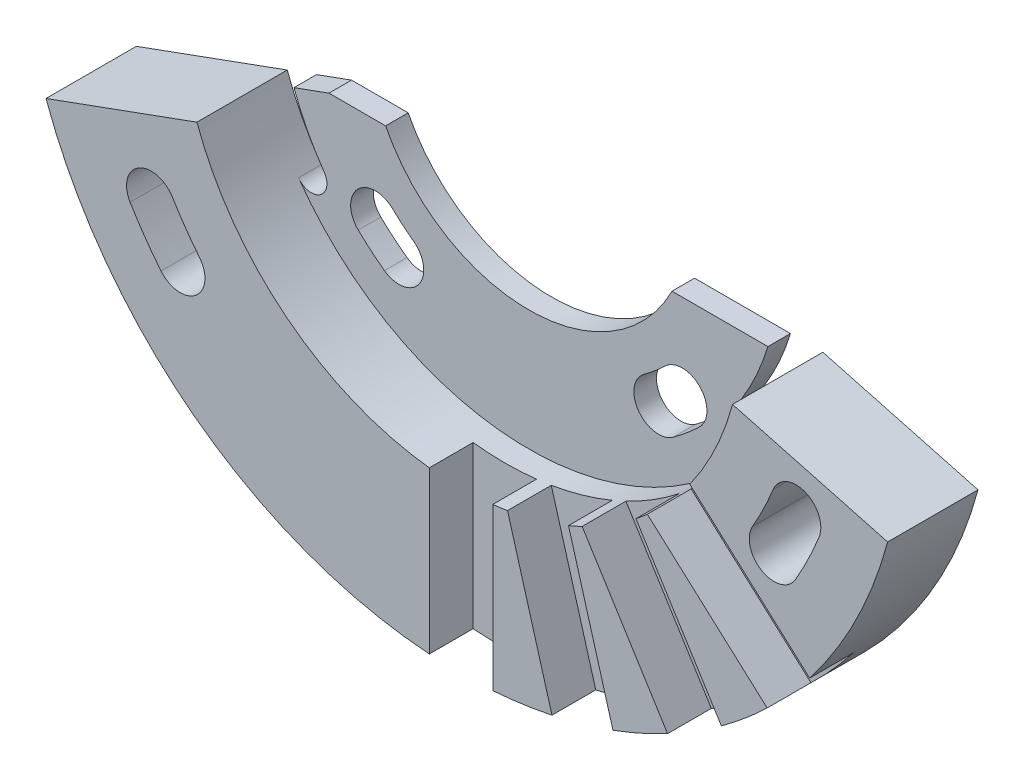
ISO-10303-21;
HEADER;
FILE_DESCRIPTION(('STEP AP214'),'2;1');
FILE_NAME('part.step','',(''),(''),'','','');
FILE_SCHEMA(('AUTOMOTIVE_DESIGN { 1 0 10303 214 1 1 1 1 }'));
ENDSEC;
DATA;
#1=APPLICATION_CONTEXT('core data for automotive mechanical design processes');
#2=APPLICATION_PROTOCOL_DEFINITION('international standard','automotive_design',2000,#1);
#3=PRODUCT_CONTEXT('',#1,'mechanical');
#4=PRODUCT('Part','Part','',(#3));
#5=PRODUCT_RELATED_PRODUCT_CATEGORY('part','',(#4));
#6=PRODUCT_DEFINITION_FORMATION('','',#4);
#7=PRODUCT_DEFINITION_CONTEXT('part definition',#1,'design');
#8=PRODUCT_DEFINITION('design','',#6,#7);
#9=PRODUCT_DEFINITION_SHAPE('','',#8);
#10=(LENGTH_UNIT() NAMED_UNIT(*) SI_UNIT(.MILLI.,.METRE.));
#11=(NAMED_UNIT(*) PLANE_ANGLE_UNIT() SI_UNIT($,.RADIAN.));
#12=(NAMED_UNIT(*) SI_UNIT($,.STERADIAN.) SOLID_ANGLE_UNIT());
#13=UNCERTAINTY_MEASURE_WITH_UNIT(LENGTH_MEASURE(1.E-05),#10,'distance_accuracy_value','');
#14=(GEOMETRIC_REPRESENTATION_CONTEXT(3) GLOBAL_UNCERTAINTY_ASSIGNED_CONTEXT((#13)) GLOBAL_UNIT_ASSIGNED_CONTEXT((#10,
#11,#12)) REPRESENTATION_CONTEXT('',''));
#15=CARTESIAN_POINT('',(0.,0.,0.));
#16=DIRECTION('',(0.,0.,1.));
#17=DIRECTION('',(1.,0.,0.));
#18=AXIS2_PLACEMENT_3D('',#15,#16,#17);
#19=CARTESIAN_POINT('',(-20.8846684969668,20.973602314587,7.14375));
#20=DIRECTION('',(0.342020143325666,-0.939692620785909,0.));
#21=DIRECTION('',(0.939692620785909,0.342020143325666,0.));
#22=AXIS2_PLACEMENT_3D('',#19,#20,#21);
#23=PLANE('',#22);
#24=DIRECTION('',(-0.939692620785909,-0.342020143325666,0.));
#25=VECTOR('',#24,1.);
#26=CARTESIAN_POINT('',(0.,28.575,1.78434999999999));
#27=LINE('',#26,#25);
#28=CARTESIAN_POINT('',(-15.80418599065,22.8227467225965,1.78434999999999));
#29=VERTEX_POINT('',#28);
#30=CARTESIAN_POINT('',(-18.5694538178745,21.8162715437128,1.78434999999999));
#31=VERTEX_POINT('',#30);
#32=EDGE_CURVE('E504',#29,#31,#27,.T.);
#33=ORIENTED_EDGE('',*,*,#32,.F.);
#34=DIRECTION('',(0.,0.,-0.999999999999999));
#35=VECTOR('',#34,1.);
#36=CARTESIAN_POINT('',(-15.80418599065,22.8227467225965,7.14375));
#37=LINE('',#36,#35);
#38=CARTESIAN_POINT('',(-15.80418599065,22.8227467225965,0.));
#39=VERTEX_POINT('',#38);
#40=EDGE_CURVE('E356',#29,#39,#37,.T.);
#41=ORIENTED_EDGE('',*,*,#40,.T.);
#42=DIRECTION('',(-0.939692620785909,-0.342020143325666,0.));
#43=VECTOR('',#42,1.);
#44=CARTESIAN_POINT('',(-20.8846684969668,20.973602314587,0.));
#45=LINE('',#44,#43);
#46=CARTESIAN_POINT('',(-18.5694538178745,21.8162715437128,0.));
#47=VERTEX_POINT('',#46);
#48=EDGE_CURVE('E348',#39,#47,#45,.T.);
#49=ORIENTED_EDGE('',*,*,#48,.T.);
#50=DIRECTION('',(0.,0.,1.));
#51=VECTOR('',#50,1.);
#52=CARTESIAN_POINT('',(-18.5694538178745,21.8162715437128,0.));
#53=LINE('',#52,#51);
#54=EDGE_CURVE('E499',#47,#31,#53,.T.);
#55=ORIENTED_EDGE('',*,*,#54,.T.);
#56=EDGE_LOOP('',(#33,#41,#49,#55));
#57=FACE_BOUND('',#56,.T.);
#58=ADVANCED_FACE('F38',(#57),#23,.F.);
#59=CARTESIAN_POINT('',(-2.50825,-31.75,3.68299999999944));
#60=DIRECTION('',(0.,0.,-1.));
#61=DIRECTION('',(-1.,0.,0.));
#62=AXIS2_PLACEMENT_3D('',#59,#60,#61);
#63=PLANE('',#62);
#64=DIRECTION('',(-0.743144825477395,0.669130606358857,0.));
#65=VECTOR('',#64,1.);
#66=CARTESIAN_POINT('',(46.5085584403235,-9.92631082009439,3.68299999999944));
#67=LINE('',#66,#65);
#68=CARTESIAN_POINT('',(27.5656590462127,7.12995240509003,3.68299999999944));
#69=VERTEX_POINT('',#68);
#70=CARTESIAN_POINT('',(18.0892210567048,15.6625754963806,3.68299999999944));
#71=VERTEX_POINT('',#70);
#72=EDGE_CURVE('E543',#69,#71,#67,.T.);
#73=ORIENTED_EDGE('',*,*,#72,.T.);
#74=CARTESIAN_POINT('',(0.,28.575,3.68299999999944));
#75=DIRECTION('',(0.,0.,-1.));
#76=DIRECTION('',(-1.,0.,0.));
#77=AXIS2_PLACEMENT_3D('',#74,#75,#76);
#78=CIRCLE('',#77,22.225);
#79=CARTESIAN_POINT('',(14.7325273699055,11.9345894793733,3.68299999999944));
#80=VERTEX_POINT('',#79);
#81=EDGE_CURVE('E521',#71,#80,#78,.T.);
#82=ORIENTED_EDGE('',*,*,#81,.T.);
#83=DIRECTION('',(-0.743144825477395,0.669130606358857,0.));
#84=VECTOR('',#83,1.);
#85=CARTESIAN_POINT('',(43.1518647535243,-13.6542968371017,3.68299999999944));
#86=LINE('',#85,#84);
#87=CARTESIAN_POINT('',(24.2089653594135,3.40196638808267,3.68299999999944));
#88=VERTEX_POINT('',#87);
#89=EDGE_CURVE('E544',#88,#80,#86,.T.);
#90=ORIENTED_EDGE('',*,*,#89,.F.);
#91=CARTESIAN_POINT('',(0.,28.575,3.68299999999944));
#92=DIRECTION('',(0.,0.,-1.));
#93=DIRECTION('',(-1.,0.,0.));
#94=AXIS2_PLACEMENT_3D('',#91,#92,#93);
#95=CIRCLE('',#94,34.925);
#96=EDGE_CURVE('E565',#69,#88,#95,.T.);
#97=ORIENTED_EDGE('',*,*,#96,.F.);
#98=EDGE_LOOP('',(#73,#82,#90,#97));
#99=FACE_BOUND('',#98,.T.);
#100=ADVANCED_FACE('F736',(#99),#63,.F.);
#101=DIRECTION('',(-0.529919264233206,0.848048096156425,0.));
#102=VECTOR('',#101,1.);
#103=CARTESIAN_POINT('',(34.0944962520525,-21.2543314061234,3.68299999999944));
#104=LINE('',#103,#102);
#105=CARTESIAN_POINT('',(20.5867559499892,0.362571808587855,3.68299999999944));
#106=VERTEX_POINT('',#105);
#107=CARTESIAN_POINT('',(13.8293287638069,11.176715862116,3.68299999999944));
#108=VERTEX_POINT('',#107);
#109=EDGE_CURVE('E547',#106,#108,#104,.T.);
#110=ORIENTED_EDGE('',*,*,#109,.T.);
#111=CARTESIAN_POINT('',(9.57509548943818,8.51837587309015,3.68299999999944));
#112=VERTEX_POINT('',#111);
#113=EDGE_CURVE('E533',#108,#112,#78,.T.);
#114=ORIENTED_EDGE('',*,*,#113,.T.);
#115=DIRECTION('',(-0.529919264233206,0.848048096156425,0.));
#116=VECTOR('',#115,1.);
#117=CARTESIAN_POINT('',(29.8402629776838,-23.9126713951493,3.68299999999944));
#118=LINE('',#117,#116);
#119=CARTESIAN_POINT('',(16.3325226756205,-2.29576818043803,3.68299999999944));
#120=VERTEX_POINT('',#119);
#121=EDGE_CURVE('E550',#120,#112,#118,.T.);
#122=ORIENTED_EDGE('',*,*,#121,.F.);
#123=EDGE_CURVE('E564',#106,#120,#95,.T.);
#124=ORIENTED_EDGE('',*,*,#123,.F.);
#125=EDGE_LOOP('',(#110,#114,#122,#124));
#126=FACE_BOUND('',#125,.T.);
#127=ADVANCED_FACE('F787',(#126),#63,.F.);
#128=DIRECTION('',(-0.275637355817,0.961261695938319,0.));
#129=VECTOR('',#128,1.);
#130=CARTESIAN_POINT('',(19.0389081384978,-28.7217444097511,3.68299999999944));
#131=LINE('',#130,#129);
#132=CARTESIAN_POINT('',(12.012860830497,-4.21900554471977,3.68299999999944));
#133=VERTEX_POINT('',#132);
#134=CARTESIAN_POINT('',(8.4979869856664,8.0388162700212,3.68299999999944));
#135=VERTEX_POINT('',#134);
#136=EDGE_CURVE('E553',#133,#135,#131,.T.);
#137=ORIENTED_EDGE('',*,*,#136,.T.);
#138=CARTESIAN_POINT('',(3.67581768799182,6.65608147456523,3.68299999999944));
#139=VERTEX_POINT('',#138);
#140=EDGE_CURVE('E515',#135,#139,#78,.T.);
#141=ORIENTED_EDGE('',*,*,#140,.T.);
#142=DIRECTION('',(-0.275637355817,0.961261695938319,0.));
#143=VECTOR('',#142,1.);
#144=CARTESIAN_POINT('',(14.2167388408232,-30.1044792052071,3.68299999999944));
#145=LINE('',#144,#143);
#146=CARTESIAN_POINT('',(7.19069153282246,-5.60174034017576,3.68299999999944));
#147=VERTEX_POINT('',#146);
#148=EDGE_CURVE('E556',#147,#139,#145,.T.);
#149=ORIENTED_EDGE('',*,*,#148,.F.);
#150=EDGE_CURVE('E559',#133,#147,#95,.T.);
#151=ORIENTED_EDGE('',*,*,#150,.F.);
#152=EDGE_LOOP('',(#137,#141,#149,#151));
#153=FACE_BOUND('',#152,.T.);
#154=ADVANCED_FACE('F777',(#153),#63,.F.);
#155=CARTESIAN_POINT('',(0.,28.575,7.14375));
#156=DIRECTION('',(0.,0.,1.));
#157=DIRECTION('',(1.,0.,0.));
#158=AXIS2_PLACEMENT_3D('',#155,#156,#157);
#159=PLANE('',#158);
#160=CARTESIAN_POINT('',(0.,28.575,7.14375));
#161=DIRECTION('',(0.,0.,1.));
#162=DIRECTION('',(1.,0.,0.));
#163=AXIS2_PLACEMENT_3D('',#160,#161,#162);
#164=CIRCLE('',#163,22.225);
#165=CARTESIAN_POINT('',(2.50825,6.49199053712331,7.14375));
#166=VERTEX_POINT('',#165);
#167=CARTESIAN_POINT('',(3.67581768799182,6.65608147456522,7.14375));
#168=VERTEX_POINT('',#167);
#169=EDGE_CURVE('E512',#166,#168,#164,.T.);
#170=ORIENTED_EDGE('',*,*,#169,.F.);
#171=DIRECTION('',(0.,1.,0.));
#172=VECTOR('',#171,1.);
#173=CARTESIAN_POINT('',(2.50825,28.575,7.14375));
#174=LINE('',#173,#172);
#175=CARTESIAN_POINT('',(2.50825,-6.25981458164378,7.14375));
#176=VERTEX_POINT('',#175);
#177=EDGE_CURVE('E624',#176,#166,#174,.T.);
#178=ORIENTED_EDGE('',*,*,#177,.F.);
#179=CARTESIAN_POINT('',(0.,28.575,7.14375));
#180=DIRECTION('',(0.,0.,1.));
#181=DIRECTION('',(1.,0.,0.));
#182=AXIS2_PLACEMENT_3D('',#179,#180,#181);
#183=CIRCLE('',#182,34.925);
#184=CARTESIAN_POINT('',(7.19069153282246,-5.60174034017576,7.14375));
#185=VERTEX_POINT('',#184);
#186=EDGE_CURVE('E610',#176,#185,#183,.T.);
#187=ORIENTED_EDGE('',*,*,#186,.T.);
#188=DIRECTION('',(0.275637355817,-0.961261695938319,0.));
#189=VECTOR('',#188,1.);
#190=CARTESIAN_POINT('',(-2.41108464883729,27.883632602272,7.14375));
#191=LINE('',#190,#189);
#192=EDGE_CURVE('E566',#168,#185,#191,.T.);
#193=ORIENTED_EDGE('',*,*,#192,.F.);
#194=EDGE_LOOP('',(#170,#178,#187,#193));
#195=FACE_BOUND('',#194,.T.);
#196=ADVANCED_FACE('F774',(#195),#159,.T.);
#197=CARTESIAN_POINT('',(13.8293287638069,11.176715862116,7.14375));
#198=VERTEX_POINT('',#197);
#199=CARTESIAN_POINT('',(14.7325273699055,11.9345894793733,7.14375));
#200=VERTEX_POINT('',#199);
#201=EDGE_CURVE('E763',#198,#200,#164,.T.);
#202=ORIENTED_EDGE('',*,*,#201,.F.);
#203=DIRECTION('',(-0.529919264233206,0.848048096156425,0.));
#204=VECTOR('',#203,1.);
#205=CARTESIAN_POINT('',(2.12711663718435,29.9041699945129,7.14375));
#206=LINE('',#205,#204);
#207=CARTESIAN_POINT('',(20.5867559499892,0.362571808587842,7.14375));
#208=VERTEX_POINT('',#207);
#209=EDGE_CURVE('E637',#208,#198,#206,.T.);
#210=ORIENTED_EDGE('',*,*,#209,.F.);
#211=CARTESIAN_POINT('',(24.2089653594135,3.40196638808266,7.14375));
#212=VERTEX_POINT('',#211);
#213=EDGE_CURVE('E744',#208,#212,#183,.T.);
#214=ORIENTED_EDGE('',*,*,#213,.T.);
#215=DIRECTION('',(0.743144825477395,-0.669130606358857,0.));
#216=VECTOR('',#215,1.);
#217=CARTESIAN_POINT('',(-1.6783468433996,26.7110069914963,7.14375));
#218=LINE('',#217,#216);
#219=EDGE_CURVE('E640',#200,#212,#218,.T.);
#220=ORIENTED_EDGE('',*,*,#219,.F.);
#221=EDGE_LOOP('',(#202,#210,#214,#220));
#222=FACE_BOUND('',#221,.T.);
#223=ADVANCED_FACE('F748',(#222),#159,.T.);
#224=CARTESIAN_POINT('',(26.494278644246,17.8706165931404,7.14375));
#225=DIRECTION('',(0.,0.,1.));
#226=DIRECTION('',(-1.,0.,0.));
#227=AXIS2_PLACEMENT_3D('',#224,#225,#226);
#228=CIRCLE('',#227,1.9558);
#229=CARTESIAN_POINT('',(28.3076648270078,17.1379610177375,7.14375));
#230=VERTEX_POINT('',#229);
#231=CARTESIAN_POINT('',(24.6808924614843,18.6032721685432,7.14375));
#232=VERTEX_POINT('',#231);
#233=EDGE_CURVE('E395',#230,#232,#228,.T.);
#234=ORIENTED_EDGE('',*,*,#233,.F.);
#235=CARTESIAN_POINT('',(9.3482085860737E-13,28.5750000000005,7.14375));
#236=DIRECTION('',(0.,0.,1.));
#237=DIRECTION('',(-1.,0.,0.));
#238=AXIS2_PLACEMENT_3D('',#235,#236,#237);
#239=CIRCLE('',#238,30.5307999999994);
#240=CARTESIAN_POINT('',(26.4404483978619,13.3096000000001,7.14375));
#241=VERTEX_POINT('',#240);
#242=EDGE_CURVE('E407',#241,#230,#239,.T.);
#243=ORIENTED_EDGE('',*,*,#242,.F.);
#244=CARTESIAN_POINT('',(24.7466759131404,14.2875,7.14375));
#245=DIRECTION('',(0.,0.,1.));
#246=DIRECTION('',(-1.,0.,0.));
#247=AXIS2_PLACEMENT_3D('',#244,#245,#246);
#248=CIRCLE('',#247,1.9558);
#249=CARTESIAN_POINT('',(23.0529034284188,15.2654,7.14375));
#250=VERTEX_POINT('',#249);
#251=EDGE_CURVE('E421',#250,#241,#248,.T.);
#252=ORIENTED_EDGE('',*,*,#251,.F.);
#253=CARTESIAN_POINT('',(9.3482085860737E-13,28.5750000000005,7.14375));
#254=DIRECTION('',(0.,0.,-1.));
#255=DIRECTION('',(-1.,0.,0.));
#256=AXIS2_PLACEMENT_3D('',#253,#254,#255);
#257=CIRCLE('',#256,26.6191999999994);
#258=EDGE_CURVE('E418',#232,#250,#257,.T.);
#259=ORIENTED_EDGE('',*,*,#258,.F.);
#260=EDGE_LOOP('',(#234,#243,#252,#259));
#261=FACE_BOUND('',#260,.T.);
#262=CARTESIAN_POINT('',(18.0892210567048,15.6625754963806,7.14375));
#263=VERTEX_POINT('',#262);
#264=CARTESIAN_POINT('',(21.4677014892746,22.8227467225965,7.14375));
#265=VERTEX_POINT('',#264);
#266=EDGE_CURVE('E503',#263,#265,#164,.T.);
#267=ORIENTED_EDGE('',*,*,#266,.F.);
#268=DIRECTION('',(-0.743144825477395,0.669130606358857,0.));
#269=VECTOR('',#268,1.);
#270=CARTESIAN_POINT('',(1.6783468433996,30.4389930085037,7.14375));
#271=LINE('',#270,#269);
#272=CARTESIAN_POINT('',(27.5656590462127,7.12995240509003,7.14375));
#273=VERTEX_POINT('',#272);
#274=EDGE_CURVE('E634',#273,#263,#271,.T.);
#275=ORIENTED_EDGE('',*,*,#274,.F.);
#276=CARTESIAN_POINT('',(33.7349594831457,19.5357448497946,7.14375));
#277=VERTEX_POINT('',#276);
#278=EDGE_CURVE('E604',#273,#277,#183,.T.);
#279=ORIENTED_EDGE('',*,*,#278,.T.);
#280=DIRECTION('',(-0.965925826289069,0.258819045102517,0.));
#281=VECTOR('',#280,1.);
#282=CARTESIAN_POINT('',(21.4677014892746,22.8227467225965,7.14375));
#283=LINE('',#282,#281);
#284=EDGE_CURVE('E609',#277,#265,#283,.T.);
#285=ORIENTED_EDGE('',*,*,#284,.T.);
#286=EDGE_LOOP('',(#267,#275,#279,#285));
#287=FACE_BOUND('',#286,.T.);
#288=ADVANCED_FACE('F709',(#261,#287),#159,.T.);
#289=CARTESIAN_POINT('',(-24.4935556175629,13.8577870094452,7.14375));
#290=DIRECTION('',(0.,0.,1.));
#291=DIRECTION('',(1.,0.,0.));
#292=AXIS2_PLACEMENT_3D('',#289,#290,#291);
#293=CIRCLE('',#292,1.9558);
#294=CARTESIAN_POINT('',(-22.8171078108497,14.8650984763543,7.14375));
#295=VERTEX_POINT('',#294);
#296=CARTESIAN_POINT('',(-26.1700034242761,12.8504755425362,7.14375));
#297=VERTEX_POINT('',#296);
#298=EDGE_CURVE('E428',#295,#297,#293,.T.);
#299=ORIENTED_EDGE('',*,*,#298,.F.);
#300=CARTESIAN_POINT('',(9.3482085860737E-13,28.5750000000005,7.14375));
#301=DIRECTION('',(0.,0.,-1.));
#302=DIRECTION('',(1.,0.,0.));
#303=AXIS2_PLACEMENT_3D('',#300,#301,#302);
#304=CIRCLE('',#303,26.6192000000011);
#305=CARTESIAN_POINT('',(-20.6870037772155,11.8229946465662,7.14375));
#306=VERTEX_POINT('',#305);
#307=EDGE_CURVE('E439',#306,#295,#304,.T.);
#308=ORIENTED_EDGE('',*,*,#307,.F.);
#309=CARTESIAN_POINT('',(-22.206945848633,10.5921698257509,7.14375));
#310=DIRECTION('',(0.,0.,1.));
#311=DIRECTION('',(1.,0.,0.));
#312=AXIS2_PLACEMENT_3D('',#309,#310,#311);
#313=CIRCLE('',#312,1.9558);
#314=CARTESIAN_POINT('',(-23.7268879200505,9.36134500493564,7.14375));
#315=VERTEX_POINT('',#314);
#316=EDGE_CURVE('E453',#315,#306,#313,.T.);
#317=ORIENTED_EDGE('',*,*,#316,.F.);
#318=CARTESIAN_POINT('',(9.3482085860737E-13,28.5750000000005,7.14375));
#319=DIRECTION('',(0.,0.,1.));
#320=DIRECTION('',(1.,0.,0.));
#321=AXIS2_PLACEMENT_3D('',#318,#319,#320);
#322=CIRCLE('',#321,30.5308000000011);
#323=EDGE_CURVE('E450',#297,#315,#322,.T.);
#324=ORIENTED_EDGE('',*,*,#323,.F.);
#325=EDGE_LOOP('',(#299,#308,#317,#324));
#326=FACE_BOUND('',#325,.T.);
#327=CARTESIAN_POINT('',(-20.8846684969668,20.9736023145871,7.14375));
#328=VERTEX_POINT('',#327);
#329=CARTESIAN_POINT('',(-2.50825,6.49199053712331,7.14375));
#330=VERTEX_POINT('',#329);
#331=EDGE_CURVE('E507',#328,#330,#164,.T.);
#332=ORIENTED_EDGE('',*,*,#331,.F.);
#333=DIRECTION('',(-0.939692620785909,-0.342020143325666,0.));
#334=VECTOR('',#333,1.);
#335=CARTESIAN_POINT('',(-20.8846684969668,20.973602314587,7.14375));
#336=LINE('',#335,#334);
#337=CARTESIAN_POINT('',(-32.8187647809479,16.6299464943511,7.14375));
#338=VERTEX_POINT('',#337);
#339=EDGE_CURVE('E602',#328,#338,#336,.T.);
#340=ORIENTED_EDGE('',*,*,#339,.T.);
#341=CARTESIAN_POINT('',(-2.50825,-6.25981458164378,7.14375));
#342=VERTEX_POINT('',#341);
#343=EDGE_CURVE('E606',#338,#342,#183,.T.);
#344=ORIENTED_EDGE('',*,*,#343,.T.);
#345=DIRECTION('',(0.,-1.,0.));
#346=VECTOR('',#345,1.);
#347=CARTESIAN_POINT('',(-2.50825,28.575,7.14375));
#348=LINE('',#347,#346);
#349=EDGE_CURVE('E627',#330,#342,#348,.T.);
#350=ORIENTED_EDGE('',*,*,#349,.F.);
#351=EDGE_LOOP('',(#332,#340,#344,#350));
#352=FACE_BOUND('',#351,.T.);
#353=ADVANCED_FACE('F706',(#326,#352),#159,.T.);
#354=DIRECTION('',(0.,0.,1.));
#355=VECTOR('',#354,1.);
#356=CARTESIAN_POINT('',(-20.8846684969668,20.9736023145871,1.78434999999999));
#357=LINE('',#356,#355);
#358=CARTESIAN_POINT('',(-20.8846684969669,20.973602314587,0.));
#359=VERTEX_POINT('',#358);
#360=EDGE_CURVE('E510',#359,#328,#357,.T.);
#361=ORIENTED_EDGE('',*,*,#360,.F.);
#362=CARTESIAN_POINT('',(-32.8187647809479,16.6299464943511,0.));
#363=VERTEX_POINT('',#362);
#364=EDGE_CURVE('E601',#359,#363,#45,.T.);
#365=ORIENTED_EDGE('',*,*,#364,.T.);
#366=DIRECTION('',(0.,0.,-1.));
#367=VECTOR('',#366,1.);
#368=CARTESIAN_POINT('',(-32.8187647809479,16.6299464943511,7.14375));
#369=LINE('',#368,#367);
#370=EDGE_CURVE('E621',#338,#363,#369,.T.);
#371=ORIENTED_EDGE('',*,*,#370,.F.);
#372=ORIENTED_EDGE('',*,*,#339,.F.);
#373=EDGE_LOOP('',(#361,#365,#371,#372));
#374=FACE_BOUND('',#373,.T.);
#375=ADVANCED_FACE('F40',(#374),#23,.F.);
#376=CARTESIAN_POINT('',(0.,28.575,7.14375));
#377=DIRECTION('',(0.,0.,-1.));
#378=DIRECTION('',(-1.,0.,0.));
#379=AXIS2_PLACEMENT_3D('',#376,#377,#378);
#380=CYLINDRICAL_SURFACE('',#379,34.925);
#381=CARTESIAN_POINT('',(12.012860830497,-4.21900554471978,7.14375));
#382=VERTEX_POINT('',#381);
#383=CARTESIAN_POINT('',(16.3325226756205,-2.29576818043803,7.14375));
#384=VERTEX_POINT('',#383);
#385=EDGE_CURVE('E749',#382,#384,#183,.T.);
#386=ORIENTED_EDGE('',*,*,#385,.F.);
#387=DIRECTION('',(0.,0.,-1.));
#388=VECTOR('',#387,1.);
#389=CARTESIAN_POINT('',(12.012860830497,-4.21900554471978,7.14375));
#390=LINE('',#389,#388);
#391=EDGE_CURVE('E583',#382,#133,#390,.T.);
#392=ORIENTED_EDGE('',*,*,#391,.T.);
#393=ORIENTED_EDGE('',*,*,#150,.T.);
#394=DIRECTION('',(0.,0.,-1.));
#395=VECTOR('',#394,1.);
#396=CARTESIAN_POINT('',(7.19069153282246,-5.60174034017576,7.14375));
#397=LINE('',#396,#395);
#398=EDGE_CURVE('E568',#147,#185,#397,.F.);
#399=ORIENTED_EDGE('',*,*,#398,.T.);
#400=ORIENTED_EDGE('',*,*,#186,.F.);
#401=DIRECTION('',(0.,0.,-1.));
#402=VECTOR('',#401,1.);
#403=CARTESIAN_POINT('',(2.50825,-6.25981458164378,7.14375));
#404=LINE('',#403,#402);
#405=CARTESIAN_POINT('',(2.50825,-6.25981458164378,3.68299999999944));
#406=VERTEX_POINT('',#405);
#407=EDGE_CURVE('E590',#176,#406,#404,.T.);
#408=ORIENTED_EDGE('',*,*,#407,.T.);
#409=CARTESIAN_POINT('',(0.,28.575,3.68299999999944));
#410=DIRECTION('',(0.,0.,-1.));
#411=DIRECTION('',(-1.,0.,0.));
#412=AXIS2_PLACEMENT_3D('',#409,#410,#411);
#413=CIRCLE('',#412,34.925);
#414=CARTESIAN_POINT('',(-2.50825,-6.25981458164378,3.68299999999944));
#415=VERTEX_POINT('',#414);
#416=EDGE_CURVE('E598',#406,#415,#413,.T.);
#417=ORIENTED_EDGE('',*,*,#416,.T.);
#418=DIRECTION('',(0.,0.,-1.));
#419=VECTOR('',#418,1.);
#420=CARTESIAN_POINT('',(-2.50825,-6.25981458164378,7.14375));
#421=LINE('',#420,#419);
#422=EDGE_CURVE('E595',#415,#342,#421,.F.);
#423=ORIENTED_EDGE('',*,*,#422,.T.);
#424=ORIENTED_EDGE('',*,*,#343,.F.);
#425=ORIENTED_EDGE('',*,*,#370,.T.);
#426=CARTESIAN_POINT('',(0.,28.575,0.));
#427=DIRECTION('',(0.,0.,1.));
#428=DIRECTION('',(1.,0.,0.));
#429=AXIS2_PLACEMENT_3D('',#426,#427,#428);
#430=CIRCLE('',#429,34.925);
#431=CARTESIAN_POINT('',(33.7349594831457,19.5357448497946,0.));
#432=VERTEX_POINT('',#431);
#433=EDGE_CURVE('E615',#363,#432,#430,.T.);
#434=ORIENTED_EDGE('',*,*,#433,.T.);
#435=DIRECTION('',(0.,0.,-1.));
#436=VECTOR('',#435,1.);
#437=CARTESIAN_POINT('',(33.7349594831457,19.5357448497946,7.14375));
#438=LINE('',#437,#436);
#439=EDGE_CURVE('E613',#277,#432,#438,.T.);
#440=ORIENTED_EDGE('',*,*,#439,.F.);
#441=ORIENTED_EDGE('',*,*,#278,.F.);
#442=DIRECTION('',(0.,0.,-1.));
#443=VECTOR('',#442,1.);
#444=CARTESIAN_POINT('',(27.5656590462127,7.12995240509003,7.14375));
#445=LINE('',#444,#443);
#446=EDGE_CURVE('E574',#273,#69,#445,.T.);
#447=ORIENTED_EDGE('',*,*,#446,.T.);
#448=ORIENTED_EDGE('',*,*,#96,.T.);
#449=DIRECTION('',(0.,0.,-1.));
#450=VECTOR('',#449,1.);
#451=CARTESIAN_POINT('',(24.2089653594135,3.40196638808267,7.14375));
#452=LINE('',#451,#450);
#453=EDGE_CURVE('E580',#88,#212,#452,.F.);
#454=ORIENTED_EDGE('',*,*,#453,.T.);
#455=ORIENTED_EDGE('',*,*,#213,.F.);
#456=DIRECTION('',(0.,0.,-1.));
#457=VECTOR('',#456,1.);
#458=CARTESIAN_POINT('',(20.5867559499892,0.362571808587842,7.14375));
#459=LINE('',#458,#457);
#460=EDGE_CURVE('E577',#208,#106,#459,.T.);
#461=ORIENTED_EDGE('',*,*,#460,.T.);
#462=ORIENTED_EDGE('',*,*,#123,.T.);
#463=DIRECTION('',(0.,0.,-1.));
#464=VECTOR('',#463,1.);
#465=CARTESIAN_POINT('',(16.3325226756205,-2.29576818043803,7.14375));
#466=LINE('',#465,#464);
#467=EDGE_CURVE('E571',#120,#384,#466,.F.);
#468=ORIENTED_EDGE('',*,*,#467,.T.);
#469=EDGE_LOOP('',(#386,#392,#393,#399,#400,#408,#417,#423,#424,#425,#434,#440,#441,#447,#448,
#454,#455,#461,#462,#468));
#470=FACE_BOUND('',#469,.T.);
#471=ADVANCED_FACE('F723',(#470),#380,.T.);
#472=CARTESIAN_POINT('',(21.4677014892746,22.8227467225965,7.14375));
#473=DIRECTION('',(-0.258819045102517,-0.965925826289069,0.));
#474=DIRECTION('',(0.965925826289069,-0.258819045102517,0.));
#475=AXIS2_PLACEMENT_3D('',#472,#473,#474);
#476=PLANE('',#475);
#477=DIRECTION('',(-0.965925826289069,0.258819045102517,0.));
#478=VECTOR('',#477,1.);
#479=CARTESIAN_POINT('',(21.4677014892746,22.8227467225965,0.));
#480=LINE('',#479,#478);
#481=CARTESIAN_POINT('',(21.4677014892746,22.8227467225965,0.));
#482=VERTEX_POINT('',#481);
#483=EDGE_CURVE('E605',#432,#482,#480,.T.);
#484=ORIENTED_EDGE('',*,*,#483,.T.);
#485=DIRECTION('',(0.,0.,1.));
#486=VECTOR('',#485,1.);
#487=CARTESIAN_POINT('',(21.4677014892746,22.8227467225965,1.78434999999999));
#488=LINE('',#487,#486);
#489=EDGE_CURVE('E513',#482,#265,#488,.T.);
#490=ORIENTED_EDGE('',*,*,#489,.T.);
#491=ORIENTED_EDGE('',*,*,#284,.F.);
#492=ORIENTED_EDGE('',*,*,#439,.T.);
#493=EDGE_LOOP('',(#484,#490,#491,#492));
#494=FACE_BOUND('',#493,.T.);
#495=ADVANCED_FACE('F759',(#494),#476,.F.);
#496=CARTESIAN_POINT('',(8.4979869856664,8.03881627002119,7.14375));
#497=VERTEX_POINT('',#496);
#498=CARTESIAN_POINT('',(9.57509548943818,8.51837587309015,7.14375));
#499=VERTEX_POINT('',#498);
#500=EDGE_CURVE('E764',#497,#499,#164,.T.);
#501=ORIENTED_EDGE('',*,*,#500,.F.);
#502=DIRECTION('',(-0.275637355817,0.961261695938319,0.));
#503=VECTOR('',#502,1.);
#504=CARTESIAN_POINT('',(2.41108464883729,29.266367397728,7.14375));
#505=LINE('',#504,#503);
#506=EDGE_CURVE('E631',#382,#497,#505,.T.);
#507=ORIENTED_EDGE('',*,*,#506,.F.);
#508=ORIENTED_EDGE('',*,*,#385,.T.);
#509=DIRECTION('',(0.529919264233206,-0.848048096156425,0.));
#510=VECTOR('',#509,1.);
#511=CARTESIAN_POINT('',(-2.12711663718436,27.245830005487,7.14375));
#512=LINE('',#511,#510);
#513=EDGE_CURVE('E629',#499,#384,#512,.T.);
#514=ORIENTED_EDGE('',*,*,#513,.F.);
#515=EDGE_LOOP('',(#501,#507,#508,#514));
#516=FACE_BOUND('',#515,.T.);
#517=ADVANCED_FACE('F683',(#516),#159,.T.);
#518=CARTESIAN_POINT('',(0.,28.575,0.));
#519=DIRECTION('',(0.,0.,1.));
#520=DIRECTION('',(1.,0.,0.));
#521=AXIS2_PLACEMENT_3D('',#518,#519,#520);
#522=PLANE('',#521);
#523=CARTESIAN_POINT('',(0.,28.575,0.));
#524=DIRECTION('',(0.,0.,-1.));
#525=DIRECTION('',(1.,0.,0.));
#526=AXIS2_PLACEMENT_3D('',#523,#524,#525);
#527=CIRCLE('',#526,15.5067);
#528=CARTESIAN_POINT('',(-9.11460957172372,16.029816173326,0.));
#529=VERTEX_POINT('',#528);
#530=CARTESIAN_POINT('',(-10.7718589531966,17.4204135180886,0.));
#531=VERTEX_POINT('',#530);
#532=EDGE_CURVE('E366',#529,#531,#527,.T.);
#533=ORIENTED_EDGE('',*,*,#532,.T.);
#534=CARTESIAN_POINT('',(-12.1304717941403,16.0135287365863,0.));
#535=DIRECTION('',(0.,0.,1.));
#536=DIRECTION('',(1.,0.,0.));
#537=AXIS2_PLACEMENT_3D('',#534,#535,#536);
#538=CIRCLE('',#537,1.9558);
#539=CARTESIAN_POINT('',(-13.4890846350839,14.6066439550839,0.));
#540=VERTEX_POINT('',#539);
#541=EDGE_CURVE('E359',#531,#540,#538,.T.);
#542=ORIENTED_EDGE('',*,*,#541,.T.);
#543=CARTESIAN_POINT('',(0.,28.575,0.));
#544=DIRECTION('',(0.,0.,1.));
#545=DIRECTION('',(1.,0.,0.));
#546=AXIS2_PLACEMENT_3D('',#543,#544,#545);
#547=CIRCLE('',#546,19.4183);
#548=CARTESIAN_POINT('',(-11.413790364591,12.865265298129,0.));
#549=VERTEX_POINT('',#548);
#550=EDGE_CURVE('E362',#540,#549,#547,.T.);
#551=ORIENTED_EDGE('',*,*,#550,.T.);
#552=CARTESIAN_POINT('',(-10.2641999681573,14.4475407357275,0.));
#553=DIRECTION('',(0.,0.,1.));
#554=DIRECTION('',(1.,0.,0.));
#555=AXIS2_PLACEMENT_3D('',#552,#553,#554);
#556=CIRCLE('',#555,1.9558);
#557=EDGE_CURVE('E60',#549,#529,#556,.T.);
#558=ORIENTED_EDGE('',*,*,#557,.T.);
#559=EDGE_LOOP('',(#533,#542,#551,#558));
#560=FACE_BOUND('',#559,.T.);
#561=CARTESIAN_POINT('',(0.,28.575,0.));
#562=DIRECTION('',(0.,0.,-1.));
#563=DIRECTION('',(1.,0.,0.));
#564=AXIS2_PLACEMENT_3D('',#561,#562,#563);
#565=CIRCLE('',#564,15.5067);
#566=CARTESIAN_POINT('',(10.7718589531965,17.4204135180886,0.));
#567=VERTEX_POINT('',#566);
#568=CARTESIAN_POINT('',(9.1146095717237,16.029816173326,0.));
#569=VERTEX_POINT('',#568);
#570=EDGE_CURVE('E388',#567,#569,#565,.T.);
#571=ORIENTED_EDGE('',*,*,#570,.T.);
#572=CARTESIAN_POINT('',(10.2641999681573,14.4475407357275,0.));
#573=DIRECTION('',(0.,0.,1.));
#574=DIRECTION('',(1.,0.,0.));
#575=AXIS2_PLACEMENT_3D('',#572,#573,#574);
#576=CIRCLE('',#575,1.9558);
#577=CARTESIAN_POINT('',(11.4137903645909,12.8652652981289,0.));
#578=VERTEX_POINT('',#577);
#579=EDGE_CURVE('E373',#569,#578,#576,.T.);
#580=ORIENTED_EDGE('',*,*,#579,.T.);
#581=CARTESIAN_POINT('',(0.,28.575,0.));
#582=DIRECTION('',(0.,0.,1.));
#583=DIRECTION('',(1.,0.,0.));
#584=AXIS2_PLACEMENT_3D('',#581,#582,#583);
#585=CIRCLE('',#584,19.4183);
#586=CARTESIAN_POINT('',(13.489084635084,14.606643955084,0.));
#587=VERTEX_POINT('',#586);
#588=EDGE_CURVE('E382',#578,#587,#585,.T.);
#589=ORIENTED_EDGE('',*,*,#588,.T.);
#590=CARTESIAN_POINT('',(12.1304717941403,16.0135287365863,0.));
#591=DIRECTION('',(0.,0.,1.));
#592=DIRECTION('',(1.,0.,0.));
#593=AXIS2_PLACEMENT_3D('',#590,#591,#592);
#594=CIRCLE('',#593,1.9558);
#595=EDGE_CURVE('E385',#587,#567,#594,.T.);
#596=ORIENTED_EDGE('',*,*,#595,.T.);
#597=EDGE_LOOP('',(#571,#580,#589,#596));
#598=FACE_BOUND('',#597,.T.);
#599=CARTESIAN_POINT('',(9.3482085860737E-13,28.5750000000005,0.));
#600=DIRECTION('',(0.,0.,1.));
#601=DIRECTION('',(-1.,0.,0.));
#602=AXIS2_PLACEMENT_3D('',#599,#600,#601);
#603=CIRCLE('',#602,30.5307999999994);
#604=CARTESIAN_POINT('',(26.4404483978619,13.3096000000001,0.));
#605=VERTEX_POINT('',#604);
#606=CARTESIAN_POINT('',(28.3076648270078,17.1379610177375,0.));
#607=VERTEX_POINT('',#606);
#608=EDGE_CURVE('E413',#605,#607,#603,.T.);
#609=ORIENTED_EDGE('',*,*,#608,.T.);
#610=CARTESIAN_POINT('',(26.494278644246,17.8706165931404,0.));
#611=DIRECTION('',(0.,0.,1.));
#612=DIRECTION('',(-1.,0.,0.));
#613=AXIS2_PLACEMENT_3D('',#610,#611,#612);
#614=CIRCLE('',#613,1.9558);
#615=CARTESIAN_POINT('',(24.6808924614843,18.6032721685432,0.));
#616=VERTEX_POINT('',#615);
#617=EDGE_CURVE('E403',#607,#616,#614,.T.);
#618=ORIENTED_EDGE('',*,*,#617,.T.);
#619=CARTESIAN_POINT('',(9.3482085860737E-13,28.5750000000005,0.));
#620=DIRECTION('',(0.,0.,-1.));
#621=DIRECTION('',(-1.,0.,0.));
#622=AXIS2_PLACEMENT_3D('',#619,#620,#621);
#623=CIRCLE('',#622,26.6191999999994);
#624=CARTESIAN_POINT('',(23.0529034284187,15.2654000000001,0.));
#625=VERTEX_POINT('',#624);
#626=EDGE_CURVE('E406',#616,#625,#623,.T.);
#627=ORIENTED_EDGE('',*,*,#626,.T.);
#628=CARTESIAN_POINT('',(24.7466759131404,14.2875,0.));
#629=DIRECTION('',(0.,0.,1.));
#630=DIRECTION('',(-1.,0.,0.));
#631=AXIS2_PLACEMENT_3D('',#628,#629,#630);
#632=CIRCLE('',#631,1.9558);
#633=EDGE_CURVE('E410',#625,#605,#632,.T.);
#634=ORIENTED_EDGE('',*,*,#633,.T.);
#635=EDGE_LOOP('',(#609,#618,#627,#634));
#636=FACE_BOUND('',#635,.T.);
#637=CARTESIAN_POINT('',(9.3482085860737E-13,28.5750000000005,0.));
#638=DIRECTION('',(0.,0.,-1.));
#639=DIRECTION('',(1.,0.,0.));
#640=AXIS2_PLACEMENT_3D('',#637,#638,#639);
#641=CIRCLE('',#640,26.6192000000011);
#642=CARTESIAN_POINT('',(-20.6870037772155,11.8229946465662,0.));
#643=VERTEX_POINT('',#642);
#644=CARTESIAN_POINT('',(-22.8171078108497,14.8650984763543,0.));
#645=VERTEX_POINT('',#644);
#646=EDGE_CURVE('E445',#643,#645,#641,.T.);
#647=ORIENTED_EDGE('',*,*,#646,.T.);
#648=CARTESIAN_POINT('',(-24.4935556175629,13.8577870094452,0.));
#649=DIRECTION('',(0.,0.,1.));
#650=DIRECTION('',(1.,0.,0.));
#651=AXIS2_PLACEMENT_3D('',#648,#649,#650);
#652=CIRCLE('',#651,1.9558);
#653=CARTESIAN_POINT('',(-26.1700034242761,12.8504755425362,0.));
#654=VERTEX_POINT('',#653);
#655=EDGE_CURVE('E435',#645,#654,#652,.T.);
#656=ORIENTED_EDGE('',*,*,#655,.T.);
#657=CARTESIAN_POINT('',(9.3482085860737E-13,28.5750000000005,0.));
#658=DIRECTION('',(0.,0.,1.));
#659=DIRECTION('',(1.,0.,0.));
#660=AXIS2_PLACEMENT_3D('',#657,#658,#659);
#661=CIRCLE('',#660,30.5308000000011);
#662=CARTESIAN_POINT('',(-23.7268879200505,9.36134500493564,0.));
#663=VERTEX_POINT('',#662);
#664=EDGE_CURVE('E438',#654,#663,#661,.T.);
#665=ORIENTED_EDGE('',*,*,#664,.T.);
#666=CARTESIAN_POINT('',(-22.206945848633,10.5921698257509,0.));
#667=DIRECTION('',(0.,0.,1.));
#668=DIRECTION('',(1.,0.,0.));
#669=AXIS2_PLACEMENT_3D('',#666,#667,#668);
#670=CIRCLE('',#669,1.9558);
#671=EDGE_CURVE('E442',#663,#643,#670,.T.);
#672=ORIENTED_EDGE('',*,*,#671,.T.);
#673=EDGE_LOOP('',(#647,#656,#665,#672));
#674=FACE_BOUND('',#673,.T.);
#675=CARTESIAN_POINT('',(0.,28.575,0.));
#676=DIRECTION('',(0.,0.,1.));
#677=DIRECTION('',(1.,0.,0.));
#678=AXIS2_PLACEMENT_3D('',#675,#676,#677);
#679=CIRCLE('',#678,12.7);
#680=CARTESIAN_POINT('',(-11.3226137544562,22.8227467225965,0.));
#681=VERTEX_POINT('',#680);
#682=CARTESIAN_POINT('',(11.3226137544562,22.8227467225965,0.));
#683=VERTEX_POINT('',#682);
#684=EDGE_CURVE('E339',#681,#683,#679,.T.);
#685=ORIENTED_EDGE('',*,*,#684,.T.);
#686=DIRECTION('',(1.,0.,0.));
#687=VECTOR('',#686,1.);
#688=CARTESIAN_POINT('',(11.3226137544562,22.8227467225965,0.));
#689=LINE('',#688,#687);
#690=CARTESIAN_POINT('',(18.9054650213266,22.8227467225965,0.));
#691=VERTEX_POINT('',#690);
#692=EDGE_CURVE('E336',#683,#691,#689,.T.);
#693=ORIENTED_EDGE('',*,*,#692,.T.);
#694=CARTESIAN_POINT('',(0.,28.5750000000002,0.));
#695=DIRECTION('',(0.,0.,-1.));
#696=DIRECTION('',(1.,0.,0.));
#697=AXIS2_PLACEMENT_3D('',#694,#695,#696);
#698=CIRCLE('',#697,19.7612000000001);
#699=CARTESIAN_POINT('',(16.1874273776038,17.2404413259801,0.));
#700=VERTEX_POINT('',#699);
#701=EDGE_CURVE('E473',#691,#700,#698,.T.);
#702=ORIENTED_EDGE('',*,*,#701,.T.);
#703=CARTESIAN_POINT('',(17.1965407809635,16.5338525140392,0.));
#704=DIRECTION('',(0.,0.,1.));
#705=DIRECTION('',(1.,0.,0.));
#706=AXIS2_PLACEMENT_3D('',#703,#704,#705);
#707=CIRCLE('',#706,1.2319);
#708=CARTESIAN_POINT('',(18.2056541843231,15.8272637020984,0.));
#709=VERTEX_POINT('',#708);
#710=EDGE_CURVE('E467',#700,#709,#707,.T.);
#711=ORIENTED_EDGE('',*,*,#710,.T.);
#712=CARTESIAN_POINT('',(0.,28.5750000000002,0.));
#713=DIRECTION('',(0.,0.,1.));
#714=DIRECTION('',(1.,0.,0.));
#715=AXIS2_PLACEMENT_3D('',#712,#713,#714);
#716=CIRCLE('',#715,22.2250000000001);
#717=EDGE_CURVE('E470',#709,#482,#716,.T.);
#718=ORIENTED_EDGE('',*,*,#717,.T.);
#719=ORIENTED_EDGE('',*,*,#483,.F.);
#720=ORIENTED_EDGE('',*,*,#433,.F.);
#721=ORIENTED_EDGE('',*,*,#364,.F.);
#722=CARTESIAN_POINT('',(0.,28.5750000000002,0.));
#723=DIRECTION('',(0.,0.,1.));
#724=DIRECTION('',(1.,0.,0.));
#725=AXIS2_PLACEMENT_3D('',#722,#723,#724);
#726=CIRCLE('',#725,22.2250000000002);
#727=CARTESIAN_POINT('',(-18.2056541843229,15.8272637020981,0.));
#728=VERTEX_POINT('',#727);
#729=EDGE_CURVE('E483',#359,#728,#726,.T.);
#730=ORIENTED_EDGE('',*,*,#729,.T.);
#731=CARTESIAN_POINT('',(-17.1965407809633,16.5338525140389,0.));
#732=DIRECTION('',(0.,0.,1.));
#733=DIRECTION('',(1.,0.,0.));
#734=AXIS2_PLACEMENT_3D('',#731,#732,#733);
#735=CIRCLE('',#734,1.2319);
#736=CARTESIAN_POINT('',(-16.1874273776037,17.2404413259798,0.));
#737=VERTEX_POINT('',#736);
#738=EDGE_CURVE('E486',#728,#737,#735,.T.);
#739=ORIENTED_EDGE('',*,*,#738,.T.);
#740=CARTESIAN_POINT('',(0.,28.5750000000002,0.));
#741=DIRECTION('',(0.,0.,-1.));
#742=DIRECTION('',(1.,0.,0.));
#743=AXIS2_PLACEMENT_3D('',#740,#741,#742);
#744=CIRCLE('',#743,19.7612000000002);
#745=EDGE_CURVE('E490',#737,#47,#744,.T.);
#746=ORIENTED_EDGE('',*,*,#745,.T.);
#747=ORIENTED_EDGE('',*,*,#48,.F.);
#748=DIRECTION('',(1.,0.,0.));
#749=VECTOR('',#748,1.);
#750=CARTESIAN_POINT('',(-21.6876014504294,22.8227467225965,0.));
#751=LINE('',#750,#749);
#752=EDGE_CURVE('E328',#39,#681,#751,.T.);
#753=ORIENTED_EDGE('',*,*,#752,.T.);
#754=EDGE_LOOP('',(#685,#693,#702,#711,#718,#719,#720,#721,#730,#739,#746,#747,#753));
#755=FACE_BOUND('',#754,.T.);
#756=ADVANCED_FACE('F346',(#560,#598,#636,#674,#755),#522,.F.);
#757=DIRECTION('',(0.,1.,0.));
#758=VECTOR('',#757,1.);
#759=CARTESIAN_POINT('',(2.50825,-31.75,3.68299999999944));
#760=LINE('',#759,#758);
#761=CARTESIAN_POINT('',(2.50825,6.49199053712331,3.68299999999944));
#762=VERTEX_POINT('',#761);
#763=EDGE_CURVE('E586',#406,#762,#760,.T.);
#764=ORIENTED_EDGE('',*,*,#763,.T.);
#765=CARTESIAN_POINT('',(-2.50825,6.49199053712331,3.68299999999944));
#766=VERTEX_POINT('',#765);
#767=EDGE_CURVE('E520',#762,#766,#78,.T.);
#768=ORIENTED_EDGE('',*,*,#767,.T.);
#769=DIRECTION('',(0.,1.,0.));
#770=VECTOR('',#769,1.);
#771=CARTESIAN_POINT('',(-2.50825,-31.75,3.68299999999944));
#772=LINE('',#771,#770);
#773=EDGE_CURVE('E587',#415,#766,#772,.T.);
#774=ORIENTED_EDGE('',*,*,#773,.F.);
#775=ORIENTED_EDGE('',*,*,#416,.F.);
#776=EDGE_LOOP('',(#764,#768,#774,#775));
#777=FACE_BOUND('',#776,.T.);
#778=ADVANCED_FACE('F682',(#777),#63,.F.);
#779=CARTESIAN_POINT('',(-2.50825,-31.75,10.0329999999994));
#780=DIRECTION('',(-1.,0.,0.));
#781=DIRECTION('',(0.,0.,1.));
#782=AXIS2_PLACEMENT_3D('',#779,#780,#781);
#783=PLANE('',#782);
#784=ORIENTED_EDGE('',*,*,#773,.T.);
#785=DIRECTION('',(0.,0.,1.));
#786=VECTOR('',#785,1.);
#787=CARTESIAN_POINT('',(-2.50825,6.49199053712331,1.78434999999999));
#788=LINE('',#787,#786);
#789=EDGE_CURVE('E540',#766,#330,#788,.T.);
#790=ORIENTED_EDGE('',*,*,#789,.T.);
#791=ORIENTED_EDGE('',*,*,#349,.T.);
#792=ORIENTED_EDGE('',*,*,#422,.F.);
#793=EDGE_LOOP('',(#784,#790,#791,#792));
#794=FACE_BOUND('',#793,.T.);
#795=ADVANCED_FACE('F726',(#794),#783,.F.);
#796=CARTESIAN_POINT('',(2.50825,-31.75,10.0329999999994));
#797=DIRECTION('',(1.,0.,0.));
#798=DIRECTION('',(0.,0.,-1.));
#799=AXIS2_PLACEMENT_3D('',#796,#797,#798);
#800=PLANE('',#799);
#801=ORIENTED_EDGE('',*,*,#177,.T.);
#802=DIRECTION('',(0.,0.,1.));
#803=VECTOR('',#802,1.);
#804=CARTESIAN_POINT('',(2.50825,6.49199053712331,1.78434999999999));
#805=LINE('',#804,#803);
#806=EDGE_CURVE('E537',#166,#762,#805,.F.);
#807=ORIENTED_EDGE('',*,*,#806,.T.);
#808=ORIENTED_EDGE('',*,*,#763,.F.);
#809=ORIENTED_EDGE('',*,*,#407,.F.);
#810=EDGE_LOOP('',(#801,#807,#808,#809));
#811=FACE_BOUND('',#810,.T.);
#812=ADVANCED_FACE('F821',(#811),#800,.F.);
#813=CARTESIAN_POINT('',(14.2167388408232,-30.1044792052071,10.0329999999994));
#814=DIRECTION('',(-0.961261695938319,-0.275637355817,0.));
#815=DIRECTION('',(0.275637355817,-0.961261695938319,0.));
#816=AXIS2_PLACEMENT_3D('',#813,#814,#815);
#817=PLANE('',#816);
#818=ORIENTED_EDGE('',*,*,#148,.T.);
#819=DIRECTION('',(0.,0.,1.));
#820=VECTOR('',#819,1.);
#821=CARTESIAN_POINT('',(3.67581768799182,6.65608147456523,1.78434999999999));
#822=LINE('',#821,#820);
#823=EDGE_CURVE('E519',#139,#168,#822,.T.);
#824=ORIENTED_EDGE('',*,*,#823,.T.);
#825=ORIENTED_EDGE('',*,*,#192,.T.);
#826=ORIENTED_EDGE('',*,*,#398,.F.);
#827=EDGE_LOOP('',(#818,#824,#825,#826));
#828=FACE_BOUND('',#827,.T.);
#829=ADVANCED_FACE('F771',(#828),#817,.F.);
#830=CARTESIAN_POINT('',(29.8402629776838,-23.9126713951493,10.0329999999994));
#831=DIRECTION('',(-0.848048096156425,-0.529919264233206,0.));
#832=DIRECTION('',(0.529919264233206,-0.848048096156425,0.));
#833=AXIS2_PLACEMENT_3D('',#830,#831,#832);
#834=PLANE('',#833);
#835=ORIENTED_EDGE('',*,*,#121,.T.);
#836=DIRECTION('',(0.,0.,1.));
#837=VECTOR('',#836,1.);
#838=CARTESIAN_POINT('',(9.57509548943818,8.51837587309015,1.78434999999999));
#839=LINE('',#838,#837);
#840=EDGE_CURVE('E534',#112,#499,#839,.T.);
#841=ORIENTED_EDGE('',*,*,#840,.T.);
#842=ORIENTED_EDGE('',*,*,#513,.T.);
#843=ORIENTED_EDGE('',*,*,#467,.F.);
#844=EDGE_LOOP('',(#835,#841,#842,#843));
#845=FACE_BOUND('',#844,.T.);
#846=ADVANCED_FACE('F786',(#845),#834,.F.);
#847=CARTESIAN_POINT('',(46.5085584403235,-9.92631082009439,10.0329999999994));
#848=DIRECTION('',(0.669130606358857,0.743144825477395,0.));
#849=DIRECTION('',(-0.743144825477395,0.669130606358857,0.));
#850=AXIS2_PLACEMENT_3D('',#847,#848,#849);
#851=PLANE('',#850);
#852=ORIENTED_EDGE('',*,*,#274,.T.);
#853=DIRECTION('',(0.,0.,1.));
#854=VECTOR('',#853,1.);
#855=CARTESIAN_POINT('',(18.0892210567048,15.6625754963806,1.78434999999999));
#856=LINE('',#855,#854);
#857=EDGE_CURVE('E527',#263,#71,#856,.F.);
#858=ORIENTED_EDGE('',*,*,#857,.T.);
#859=ORIENTED_EDGE('',*,*,#72,.F.);
#860=ORIENTED_EDGE('',*,*,#446,.F.);
#861=EDGE_LOOP('',(#852,#858,#859,#860));
#862=FACE_BOUND('',#861,.T.);
#863=ADVANCED_FACE('F792',(#862),#851,.F.);
#864=CARTESIAN_POINT('',(34.0944962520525,-21.2543314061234,10.0329999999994));
#865=DIRECTION('',(0.848048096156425,0.529919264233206,0.));
#866=DIRECTION('',(-0.529919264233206,0.848048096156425,0.));
#867=AXIS2_PLACEMENT_3D('',#864,#865,#866);
#868=PLANE('',#867);
#869=ORIENTED_EDGE('',*,*,#209,.T.);
#870=DIRECTION('',(0.,0.,1.));
#871=VECTOR('',#870,1.);
#872=CARTESIAN_POINT('',(13.8293287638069,11.176715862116,1.78434999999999));
#873=LINE('',#872,#871);
#874=EDGE_CURVE('E530',#198,#108,#873,.F.);
#875=ORIENTED_EDGE('',*,*,#874,.T.);
#876=ORIENTED_EDGE('',*,*,#109,.F.);
#877=ORIENTED_EDGE('',*,*,#460,.F.);
#878=EDGE_LOOP('',(#869,#875,#876,#877));
#879=FACE_BOUND('',#878,.T.);
#880=ADVANCED_FACE('F790',(#879),#868,.F.);
#881=CARTESIAN_POINT('',(43.1518647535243,-13.6542968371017,10.0329999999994));
#882=DIRECTION('',(-0.669130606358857,-0.743144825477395,0.));
#883=DIRECTION('',(0.743144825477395,-0.669130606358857,0.));
#884=AXIS2_PLACEMENT_3D('',#881,#882,#883);
#885=PLANE('',#884);
#886=ORIENTED_EDGE('',*,*,#89,.T.);
#887=DIRECTION('',(0.,0.,1.));
#888=VECTOR('',#887,1.);
#889=CARTESIAN_POINT('',(14.7325273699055,11.9345894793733,1.78434999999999));
#890=LINE('',#889,#888);
#891=EDGE_CURVE('E524',#80,#200,#890,.T.);
#892=ORIENTED_EDGE('',*,*,#891,.T.);
#893=ORIENTED_EDGE('',*,*,#219,.T.);
#894=ORIENTED_EDGE('',*,*,#453,.F.);
#895=EDGE_LOOP('',(#886,#892,#893,#894));
#896=FACE_BOUND('',#895,.T.);
#897=ADVANCED_FACE('F740',(#896),#885,.F.);
#898=CARTESIAN_POINT('',(19.0389081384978,-28.7217444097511,10.0329999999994));
#899=DIRECTION('',(0.961261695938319,0.275637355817,0.));
#900=DIRECTION('',(-0.275637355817,0.961261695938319,0.));
#901=AXIS2_PLACEMENT_3D('',#898,#899,#900);
#902=PLANE('',#901);
#903=ORIENTED_EDGE('',*,*,#506,.T.);
#904=DIRECTION('',(0.,0.,1.));
#905=VECTOR('',#904,1.);
#906=CARTESIAN_POINT('',(8.4979869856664,8.0388162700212,1.78434999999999));
#907=LINE('',#906,#905);
#908=EDGE_CURVE('E642',#497,#135,#907,.F.);
#909=ORIENTED_EDGE('',*,*,#908,.T.);
#910=ORIENTED_EDGE('',*,*,#136,.F.);
#911=ORIENTED_EDGE('',*,*,#391,.F.);
#912=EDGE_LOOP('',(#903,#909,#910,#911));
#913=FACE_BOUND('',#912,.T.);
#914=ADVANCED_FACE('F780',(#913),#902,.F.);
#915=CARTESIAN_POINT('',(0.,28.575,1.78434999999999));
#916=DIRECTION('',(0.,0.,1.));
#917=DIRECTION('',(1.,0.,0.));
#918=AXIS2_PLACEMENT_3D('',#915,#916,#917);
#919=CYLINDRICAL_SURFACE('',#918,22.225);
#920=ORIENTED_EDGE('',*,*,#767,.F.);
#921=ORIENTED_EDGE('',*,*,#806,.F.);
#922=ORIENTED_EDGE('',*,*,#169,.T.);
#923=ORIENTED_EDGE('',*,*,#823,.F.);
#924=ORIENTED_EDGE('',*,*,#140,.F.);
#925=ORIENTED_EDGE('',*,*,#908,.F.);
#926=ORIENTED_EDGE('',*,*,#500,.T.);
#927=ORIENTED_EDGE('',*,*,#840,.F.);
#928=ORIENTED_EDGE('',*,*,#113,.F.);
#929=ORIENTED_EDGE('',*,*,#874,.F.);
#930=ORIENTED_EDGE('',*,*,#201,.T.);
#931=ORIENTED_EDGE('',*,*,#891,.F.);
#932=ORIENTED_EDGE('',*,*,#81,.F.);
#933=ORIENTED_EDGE('',*,*,#857,.F.);
#934=ORIENTED_EDGE('',*,*,#266,.T.);
#935=ORIENTED_EDGE('',*,*,#489,.F.);
#936=ORIENTED_EDGE('',*,*,#717,.F.);
#937=DIRECTION('',(0.,0.,1.));
#938=VECTOR('',#937,1.);
#939=CARTESIAN_POINT('',(18.2056541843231,15.8272637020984,0.));
#940=LINE('',#939,#938);
#941=CARTESIAN_POINT('',(18.2056541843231,15.8272637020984,1.78434999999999));
#942=VERTEX_POINT('',#941);
#943=EDGE_CURVE('E475',#709,#942,#940,.T.);
#944=ORIENTED_EDGE('',*,*,#943,.T.);
#945=CARTESIAN_POINT('',(0.,28.575,1.78434999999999));
#946=DIRECTION('',(0.,0.,1.));
#947=DIRECTION('',(1.,0.,0.));
#948=AXIS2_PLACEMENT_3D('',#945,#946,#947);
#949=CIRCLE('',#948,22.225);
#950=CARTESIAN_POINT('',(-18.2056541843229,15.8272637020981,1.78434999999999));
#951=VERTEX_POINT('',#950);
#952=EDGE_CURVE('E506',#951,#942,#949,.T.);
#953=ORIENTED_EDGE('',*,*,#952,.F.);
#954=DIRECTION('',(0.,0.,1.));
#955=VECTOR('',#954,1.);
#956=CARTESIAN_POINT('',(-18.2056541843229,15.8272637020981,0.));
#957=LINE('',#956,#955);
#958=EDGE_CURVE('E492',#728,#951,#957,.T.);
#959=ORIENTED_EDGE('',*,*,#958,.F.);
#960=ORIENTED_EDGE('',*,*,#729,.F.);
#961=ORIENTED_EDGE('',*,*,#360,.T.);
#962=ORIENTED_EDGE('',*,*,#331,.T.);
#963=ORIENTED_EDGE('',*,*,#789,.F.);
#964=EDGE_LOOP('',(#920,#921,#922,#923,#924,#925,#926,#927,#928,#929,#930,#931,#932,#933,#934,
#935,#936,#944,#953,#959,#960,#961,#962,#963));
#965=FACE_BOUND('',#964,.T.);
#966=ADVANCED_FACE('F762',(#965),#919,.F.);
#967=CARTESIAN_POINT('',(0.,28.575,1.78434999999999));
#968=DIRECTION('',(0.,0.,1.));
#969=DIRECTION('',(1.,0.,0.));
#970=AXIS2_PLACEMENT_3D('',#967,#968,#969);
#971=PLANE('',#970);
#972=DIRECTION('',(1.,0.,0.));
#973=VECTOR('',#972,1.);
#974=CARTESIAN_POINT('',(11.3226137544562,22.8227467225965,1.78434999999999));
#975=LINE('',#974,#973);
#976=CARTESIAN_POINT('',(11.3226137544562,22.8227467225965,1.78434999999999));
#977=VERTEX_POINT('',#976);
#978=CARTESIAN_POINT('',(18.9054650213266,22.8227467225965,1.78434999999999));
#979=VERTEX_POINT('',#978);
#980=EDGE_CURVE('E53',#977,#979,#975,.T.);
#981=ORIENTED_EDGE('',*,*,#980,.F.);
#982=CARTESIAN_POINT('',(0.,28.575,1.78434999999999));
#983=DIRECTION('',(0.,0.,1.));
#984=DIRECTION('',(1.,0.,0.));
#985=AXIS2_PLACEMENT_3D('',#982,#983,#984);
#986=CIRCLE('',#985,12.7);
#987=CARTESIAN_POINT('',(-11.3226137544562,22.8227467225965,1.78434999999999));
#988=VERTEX_POINT('',#987);
#989=EDGE_CURVE('E350',#988,#977,#986,.T.);
#990=ORIENTED_EDGE('',*,*,#989,.F.);
#991=DIRECTION('',(1.,0.,0.));
#992=VECTOR('',#991,1.);
#993=CARTESIAN_POINT('',(-21.6876014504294,22.8227467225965,1.78434999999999));
#994=LINE('',#993,#992);
#995=EDGE_CURVE('E331',#29,#988,#994,.T.);
#996=ORIENTED_EDGE('',*,*,#995,.F.);
#997=ORIENTED_EDGE('',*,*,#32,.T.);
#998=CARTESIAN_POINT('',(0.,28.5750000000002,1.78434999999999));
#999=DIRECTION('',(0.,0.,-1.));
#1000=DIRECTION('',(1.,0.,0.));
#1001=AXIS2_PLACEMENT_3D('',#998,#999,#1000);
#1002=CIRCLE('',#1001,19.7612000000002);
#1003=CARTESIAN_POINT('',(-16.1874273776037,17.2404413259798,1.78434999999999));
#1004=VERTEX_POINT('',#1003);
#1005=EDGE_CURVE('E487',#1004,#31,#1002,.T.);
#1006=ORIENTED_EDGE('',*,*,#1005,.F.);
#1007=CARTESIAN_POINT('',(-17.1965407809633,16.5338525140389,1.78434999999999));
#1008=DIRECTION('',(0.,0.,1.));
#1009=DIRECTION('',(1.,0.,0.));
#1010=AXIS2_PLACEMENT_3D('',#1007,#1008,#1009);
#1011=CIRCLE('',#1010,1.2319);
#1012=EDGE_CURVE('E480',#951,#1004,#1011,.T.);
#1013=ORIENTED_EDGE('',*,*,#1012,.F.);
#1014=ORIENTED_EDGE('',*,*,#952,.T.);
#1015=CARTESIAN_POINT('',(17.1965407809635,16.5338525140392,1.78434999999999));
#1016=DIRECTION('',(0.,0.,1.));
#1017=DIRECTION('',(1.,0.,0.));
#1018=AXIS2_PLACEMENT_3D('',#1015,#1016,#1017);
#1019=CIRCLE('',#1018,1.2319);
#1020=CARTESIAN_POINT('',(16.1874273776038,17.2404413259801,1.78434999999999));
#1021=VERTEX_POINT('',#1020);
#1022=EDGE_CURVE('E460',#1021,#942,#1019,.T.);
#1023=ORIENTED_EDGE('',*,*,#1022,.F.);
#1024=CARTESIAN_POINT('',(0.,28.5750000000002,1.78434999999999));
#1025=DIRECTION('',(0.,0.,1.));
#1026=DIRECTION('',(1.,0.,0.));
#1027=AXIS2_PLACEMENT_3D('',#1024,#1025,#1026);
#1028=CIRCLE('',#1027,19.7612000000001);
#1029=EDGE_CURVE('E645',#979,#1021,#1028,.F.);
#1030=ORIENTED_EDGE('',*,*,#1029,.F.);
#1031=EDGE_LOOP('',(#981,#990,#996,#997,#1006,#1013,#1014,#1023,#1030));
#1032=FACE_BOUND('',#1031,.T.);
#1033=CARTESIAN_POINT('',(-12.1304717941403,16.0135287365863,1.78434999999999));
#1034=DIRECTION('',(0.,0.,1.));
#1035=DIRECTION('',(1.,0.,0.));
#1036=AXIS2_PLACEMENT_3D('',#1033,#1034,#1035);
#1037=CIRCLE('',#1036,1.9558);
#1038=CARTESIAN_POINT('',(-10.7718589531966,17.4204135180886,1.78434999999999));
#1039=VERTEX_POINT('',#1038);
#1040=CARTESIAN_POINT('',(-13.4890846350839,14.6066439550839,1.78434999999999));
#1041=VERTEX_POINT('',#1040);
#1042=EDGE_CURVE('E46',#1039,#1041,#1037,.T.);
#1043=ORIENTED_EDGE('',*,*,#1042,.F.);
#1044=CARTESIAN_POINT('',(0.,28.575,1.78434999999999));
#1045=DIRECTION('',(0.,0.,1.));
#1046=DIRECTION('',(1.,0.,0.));
#1047=AXIS2_PLACEMENT_3D('',#1044,#1045,#1046);
#1048=CIRCLE('',#1047,15.5067);
#1049=CARTESIAN_POINT('',(-9.11460957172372,16.029816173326,1.78434999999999));
#1050=VERTEX_POINT('',#1049);
#1051=EDGE_CURVE('E660',#1050,#1039,#1048,.F.);
#1052=ORIENTED_EDGE('',*,*,#1051,.F.);
#1053=CARTESIAN_POINT('',(-10.2641999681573,14.4475407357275,1.78434999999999));
#1054=DIRECTION('',(0.,0.,1.));
#1055=DIRECTION('',(1.,0.,0.));
#1056=AXIS2_PLACEMENT_3D('',#1053,#1054,#1055);
#1057=CIRCLE('',#1056,1.9558);
#1058=CARTESIAN_POINT('',(-11.413790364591,12.865265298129,1.78434999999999));
#1059=VERTEX_POINT('',#1058);
#1060=EDGE_CURVE('E658',#1059,#1050,#1057,.T.);
#1061=ORIENTED_EDGE('',*,*,#1060,.F.);
#1062=CARTESIAN_POINT('',(0.,28.575,1.78434999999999));
#1063=DIRECTION('',(0.,0.,1.));
#1064=DIRECTION('',(1.,0.,0.));
#1065=AXIS2_PLACEMENT_3D('',#1062,#1063,#1064);
#1066=CIRCLE('',#1065,19.4183);
#1067=EDGE_CURVE('E656',#1041,#1059,#1066,.T.);
#1068=ORIENTED_EDGE('',*,*,#1067,.F.);
#1069=EDGE_LOOP('',(#1043,#1052,#1061,#1068));
#1070=FACE_BOUND('',#1069,.T.);
#1071=CARTESIAN_POINT('',(10.2641999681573,14.4475407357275,1.78434999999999));
#1072=DIRECTION('',(0.,0.,1.));
#1073=DIRECTION('',(1.,0.,0.));
#1074=AXIS2_PLACEMENT_3D('',#1071,#1072,#1073);
#1075=CIRCLE('',#1074,1.9558);
#1076=CARTESIAN_POINT('',(9.1146095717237,16.029816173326,1.78434999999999));
#1077=VERTEX_POINT('',#1076);
#1078=CARTESIAN_POINT('',(11.4137903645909,12.8652652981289,1.78434999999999));
#1079=VERTEX_POINT('',#1078);
#1080=EDGE_CURVE('E653',#1077,#1079,#1075,.T.);
#1081=ORIENTED_EDGE('',*,*,#1080,.F.);
#1082=CARTESIAN_POINT('',(0.,28.575,1.78434999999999));
#1083=DIRECTION('',(0.,0.,1.));
#1084=DIRECTION('',(1.,0.,0.));
#1085=AXIS2_PLACEMENT_3D('',#1082,#1083,#1084);
#1086=CIRCLE('',#1085,15.5067);
#1087=CARTESIAN_POINT('',(10.7718589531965,17.4204135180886,1.78434999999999));
#1088=VERTEX_POINT('',#1087);
#1089=EDGE_CURVE('E651',#1088,#1077,#1086,.F.);
#1090=ORIENTED_EDGE('',*,*,#1089,.F.);
#1091=CARTESIAN_POINT('',(12.1304717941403,16.0135287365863,1.78434999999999));
#1092=DIRECTION('',(0.,0.,1.));
#1093=DIRECTION('',(1.,0.,0.));
#1094=AXIS2_PLACEMENT_3D('',#1091,#1092,#1093);
#1095=CIRCLE('',#1094,1.9558);
#1096=CARTESIAN_POINT('',(13.489084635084,14.606643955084,1.78434999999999));
#1097=VERTEX_POINT('',#1096);
#1098=EDGE_CURVE('E649',#1097,#1088,#1095,.T.);
#1099=ORIENTED_EDGE('',*,*,#1098,.F.);
#1100=CARTESIAN_POINT('',(0.,28.575,1.78434999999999));
#1101=DIRECTION('',(0.,0.,1.));
#1102=DIRECTION('',(1.,0.,0.));
#1103=AXIS2_PLACEMENT_3D('',#1100,#1101,#1102);
#1104=CIRCLE('',#1103,19.4183);
#1105=EDGE_CURVE('E647',#1079,#1097,#1104,.T.);
#1106=ORIENTED_EDGE('',*,*,#1105,.F.);
#1107=EDGE_LOOP('',(#1081,#1090,#1099,#1106));
#1108=FACE_BOUND('',#1107,.T.);
#1109=ADVANCED_FACE('F671',(#1032,#1070,#1108),#971,.T.);
#1110=CARTESIAN_POINT('',(0.,28.5750000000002,0.));
#1111=DIRECTION('',(0.,0.,1.));
#1112=DIRECTION('',(1.,0.,0.));
#1113=AXIS2_PLACEMENT_3D('',#1110,#1111,#1112);
#1114=CYLINDRICAL_SURFACE('',#1113,19.7612000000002);
#1115=ORIENTED_EDGE('',*,*,#745,.F.);
#1116=DIRECTION('',(0.,0.,1.));
#1117=VECTOR('',#1116,1.);
#1118=CARTESIAN_POINT('',(-16.1874273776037,17.2404413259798,0.));
#1119=LINE('',#1118,#1117);
#1120=EDGE_CURVE('E497',#737,#1004,#1119,.T.);
#1121=ORIENTED_EDGE('',*,*,#1120,.T.);
#1122=ORIENTED_EDGE('',*,*,#1005,.T.);
#1123=ORIENTED_EDGE('',*,*,#54,.F.);
#1124=EDGE_LOOP('',(#1115,#1121,#1122,#1123));
#1125=FACE_BOUND('',#1124,.T.);
#1126=ADVANCED_FACE('F969',(#1125),#1114,.T.);
#1127=CARTESIAN_POINT('',(-17.1965407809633,16.5338525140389,0.));
#1128=DIRECTION('',(0.,0.,1.));
#1129=DIRECTION('',(1.,0.,0.));
#1130=AXIS2_PLACEMENT_3D('',#1127,#1128,#1129);
#1131=CYLINDRICAL_SURFACE('',#1130,1.2319);
#1132=ORIENTED_EDGE('',*,*,#1012,.T.);
#1133=ORIENTED_EDGE('',*,*,#1120,.F.);
#1134=ORIENTED_EDGE('',*,*,#738,.F.);
#1135=ORIENTED_EDGE('',*,*,#958,.T.);
#1136=EDGE_LOOP('',(#1132,#1133,#1134,#1135));
#1137=FACE_BOUND('',#1136,.T.);
#1138=ADVANCED_FACE('F977',(#1137),#1131,.F.);
#1139=CARTESIAN_POINT('',(0.,28.5750000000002,0.));
#1140=DIRECTION('',(0.,0.,1.));
#1141=DIRECTION('',(1.,0.,0.));
#1142=AXIS2_PLACEMENT_3D('',#1139,#1140,#1141);
#1143=CYLINDRICAL_SURFACE('',#1142,19.7612000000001);
#1144=ORIENTED_EDGE('',*,*,#701,.F.);
#1145=DIRECTION('',(0.,0.,1.));
#1146=VECTOR('',#1145,1.);
#1147=CARTESIAN_POINT('',(18.9054650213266,22.8227467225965,0.));
#1148=LINE('',#1147,#1146);
#1149=EDGE_CURVE('E11',#691,#979,#1148,.T.);
#1150=ORIENTED_EDGE('',*,*,#1149,.T.);
#1151=ORIENTED_EDGE('',*,*,#1029,.T.);
#1152=DIRECTION('',(0.,0.,1.));
#1153=VECTOR('',#1152,1.);
#1154=CARTESIAN_POINT('',(16.1874273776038,17.2404413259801,0.));
#1155=LINE('',#1154,#1153);
#1156=EDGE_CURVE('E477',#700,#1021,#1155,.T.);
#1157=ORIENTED_EDGE('',*,*,#1156,.F.);
#1158=EDGE_LOOP('',(#1144,#1150,#1151,#1157));
#1159=FACE_BOUND('',#1158,.T.);
#1160=ADVANCED_FACE('F985',(#1159),#1143,.T.);
#1161=CARTESIAN_POINT('',(17.1965407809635,16.5338525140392,0.));
#1162=DIRECTION('',(0.,0.,1.));
#1163=DIRECTION('',(1.,0.,0.));
#1164=AXIS2_PLACEMENT_3D('',#1161,#1162,#1163);
#1165=CYLINDRICAL_SURFACE('',#1164,1.2319);
#1166=ORIENTED_EDGE('',*,*,#1022,.T.);
#1167=ORIENTED_EDGE('',*,*,#943,.F.);
#1168=ORIENTED_EDGE('',*,*,#710,.F.);
#1169=ORIENTED_EDGE('',*,*,#1156,.T.);
#1170=EDGE_LOOP('',(#1166,#1167,#1168,#1169));
#1171=FACE_BOUND('',#1170,.T.);
#1172=ADVANCED_FACE('F993',(#1171),#1165,.F.);
#1173=CARTESIAN_POINT('',(-24.4935556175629,13.8577870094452,0.));
#1174=DIRECTION('',(0.,0.,1.));
#1175=DIRECTION('',(1.,0.,0.));
#1176=AXIS2_PLACEMENT_3D('',#1173,#1174,#1175);
#1177=CYLINDRICAL_SURFACE('',#1176,1.9558);
#1178=ORIENTED_EDGE('',*,*,#298,.T.);
#1179=DIRECTION('',(0.,0.,1.));
#1180=VECTOR('',#1179,1.);
#1181=CARTESIAN_POINT('',(-26.1700034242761,12.8504755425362,0.));
#1182=LINE('',#1181,#1180);
#1183=EDGE_CURVE('E448',#654,#297,#1182,.T.);
#1184=ORIENTED_EDGE('',*,*,#1183,.F.);
#1185=ORIENTED_EDGE('',*,*,#655,.F.);
#1186=DIRECTION('',(0.,0.,1.));
#1187=VECTOR('',#1186,1.);
#1188=CARTESIAN_POINT('',(-22.8171078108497,14.8650984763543,0.));
#1189=LINE('',#1188,#1187);
#1190=EDGE_CURVE('E458',#645,#295,#1189,.T.);
#1191=ORIENTED_EDGE('',*,*,#1190,.T.);
#1192=EDGE_LOOP('',(#1178,#1184,#1185,#1191));
#1193=FACE_BOUND('',#1192,.T.);
#1194=ADVANCED_FACE('F696',(#1193),#1177,.F.);
#1195=CARTESIAN_POINT('',(9.3482085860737E-13,28.5750000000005,0.));
#1196=DIRECTION('',(0.,0.,1.));
#1197=DIRECTION('',(1.,0.,0.));
#1198=AXIS2_PLACEMENT_3D('',#1195,#1196,#1197);
#1199=CYLINDRICAL_SURFACE('',#1198,26.6192000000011);
#1200=ORIENTED_EDGE('',*,*,#307,.T.);
#1201=ORIENTED_EDGE('',*,*,#1190,.F.);
#1202=ORIENTED_EDGE('',*,*,#646,.F.);
#1203=DIRECTION('',(0.,0.,1.));
#1204=VECTOR('',#1203,1.);
#1205=CARTESIAN_POINT('',(-20.6870037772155,11.8229946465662,0.));
#1206=LINE('',#1205,#1204);
#1207=EDGE_CURVE('E461',#643,#306,#1206,.T.);
#1208=ORIENTED_EDGE('',*,*,#1207,.T.);
#1209=EDGE_LOOP('',(#1200,#1201,#1202,#1208));
#1210=FACE_BOUND('',#1209,.T.);
#1211=ADVANCED_FACE('F692',(#1210),#1199,.T.);
#1212=CARTESIAN_POINT('',(-22.206945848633,10.5921698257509,0.));
#1213=DIRECTION('',(0.,0.,1.));
#1214=DIRECTION('',(1.,0.,0.));
#1215=AXIS2_PLACEMENT_3D('',#1212,#1213,#1214);
#1216=CYLINDRICAL_SURFACE('',#1215,1.9558);
#1217=ORIENTED_EDGE('',*,*,#316,.T.);
#1218=ORIENTED_EDGE('',*,*,#1207,.F.);
#1219=ORIENTED_EDGE('',*,*,#671,.F.);
#1220=DIRECTION('',(0.,0.,1.));
#1221=VECTOR('',#1220,1.);
#1222=CARTESIAN_POINT('',(-23.7268879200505,9.36134500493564,0.));
#1223=LINE('',#1222,#1221);
#1224=EDGE_CURVE('E463',#663,#315,#1223,.T.);
#1225=ORIENTED_EDGE('',*,*,#1224,.T.);
#1226=EDGE_LOOP('',(#1217,#1218,#1219,#1225));
#1227=FACE_BOUND('',#1226,.T.);
#1228=ADVANCED_FACE('F704',(#1227),#1216,.F.);
#1229=CARTESIAN_POINT('',(9.3482085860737E-13,28.5750000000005,0.));
#1230=DIRECTION('',(0.,0.,1.));
#1231=DIRECTION('',(1.,0.,0.));
#1232=AXIS2_PLACEMENT_3D('',#1229,#1230,#1231);
#1233=CYLINDRICAL_SURFACE('',#1232,30.5308000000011);
#1234=ORIENTED_EDGE('',*,*,#323,.T.);
#1235=ORIENTED_EDGE('',*,*,#1224,.F.);
#1236=ORIENTED_EDGE('',*,*,#664,.F.);
#1237=ORIENTED_EDGE('',*,*,#1183,.T.);
#1238=EDGE_LOOP('',(#1234,#1235,#1236,#1237));
#1239=FACE_BOUND('',#1238,.T.);
#1240=ADVANCED_FACE('F701',(#1239),#1233,.F.);
#1241=CARTESIAN_POINT('',(26.494278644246,17.8706165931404,0.));
#1242=DIRECTION('',(0.,0.,1.));
#1243=DIRECTION('',(1.,0.,0.));
#1244=AXIS2_PLACEMENT_3D('',#1241,#1242,#1243);
#1245=CYLINDRICAL_SURFACE('',#1244,1.9558);
#1246=ORIENTED_EDGE('',*,*,#233,.T.);
#1247=DIRECTION('',(0.,0.,1.));
#1248=VECTOR('',#1247,1.);
#1249=CARTESIAN_POINT('',(24.6808924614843,18.6032721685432,0.));
#1250=LINE('',#1249,#1248);
#1251=EDGE_CURVE('E416',#616,#232,#1250,.T.);
#1252=ORIENTED_EDGE('',*,*,#1251,.F.);
#1253=ORIENTED_EDGE('',*,*,#617,.F.);
#1254=DIRECTION('',(0.,0.,1.));
#1255=VECTOR('',#1254,1.);
#1256=CARTESIAN_POINT('',(28.3076648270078,17.1379610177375,0.));
#1257=LINE('',#1256,#1255);
#1258=EDGE_CURVE('E426',#607,#230,#1257,.T.);
#1259=ORIENTED_EDGE('',*,*,#1258,.T.);
#1260=EDGE_LOOP('',(#1246,#1252,#1253,#1259));
#1261=FACE_BOUND('',#1260,.T.);
#1262=ADVANCED_FACE('F1026',(#1261),#1245,.F.);
#1263=CARTESIAN_POINT('',(9.3482085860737E-13,28.5750000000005,0.));
#1264=DIRECTION('',(0.,0.,1.));
#1265=DIRECTION('',(1.,0.,0.));
#1266=AXIS2_PLACEMENT_3D('',#1263,#1264,#1265);
#1267=CYLINDRICAL_SURFACE('',#1266,30.5307999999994);
#1268=ORIENTED_EDGE('',*,*,#242,.T.);
#1269=ORIENTED_EDGE('',*,*,#1258,.F.);
#1270=ORIENTED_EDGE('',*,*,#608,.F.);
#1271=DIRECTION('',(0.,0.,1.));
#1272=VECTOR('',#1271,1.);
#1273=CARTESIAN_POINT('',(26.4404483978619,13.3096000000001,0.));
#1274=LINE('',#1273,#1272);
#1275=EDGE_CURVE('E429',#605,#241,#1274,.T.);
#1276=ORIENTED_EDGE('',*,*,#1275,.T.);
#1277=EDGE_LOOP('',(#1268,#1269,#1270,#1276));
#1278=FACE_BOUND('',#1277,.T.);
#1279=ADVANCED_FACE('F1033',(#1278),#1267,.F.);
#1280=CARTESIAN_POINT('',(24.7466759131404,14.2875,0.));
#1281=DIRECTION('',(0.,0.,1.));
#1282=DIRECTION('',(1.,0.,0.));
#1283=AXIS2_PLACEMENT_3D('',#1280,#1281,#1282);
#1284=CYLINDRICAL_SURFACE('',#1283,1.9558);
#1285=ORIENTED_EDGE('',*,*,#251,.T.);
#1286=ORIENTED_EDGE('',*,*,#1275,.F.);
#1287=ORIENTED_EDGE('',*,*,#633,.F.);
#1288=DIRECTION('',(0.,0.,1.));
#1289=VECTOR('',#1288,1.);
#1290=CARTESIAN_POINT('',(23.0529034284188,15.2654,0.));
#1291=LINE('',#1290,#1289);
#1292=EDGE_CURVE('E431',#625,#250,#1291,.T.);
#1293=ORIENTED_EDGE('',*,*,#1292,.T.);
#1294=EDGE_LOOP('',(#1285,#1286,#1287,#1293));
#1295=FACE_BOUND('',#1294,.T.);
#1296=ADVANCED_FACE('F1041',(#1295),#1284,.F.);
#1297=CARTESIAN_POINT('',(9.3482085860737E-13,28.5750000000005,0.));
#1298=DIRECTION('',(0.,0.,1.));
#1299=DIRECTION('',(1.,0.,0.));
#1300=AXIS2_PLACEMENT_3D('',#1297,#1298,#1299);
#1301=CYLINDRICAL_SURFACE('',#1300,26.6191999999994);
#1302=ORIENTED_EDGE('',*,*,#258,.T.);
#1303=ORIENTED_EDGE('',*,*,#1292,.F.);
#1304=ORIENTED_EDGE('',*,*,#626,.F.);
#1305=ORIENTED_EDGE('',*,*,#1251,.T.);
#1306=EDGE_LOOP('',(#1302,#1303,#1304,#1305));
#1307=FACE_BOUND('',#1306,.T.);
#1308=ADVANCED_FACE('F1049',(#1307),#1301,.T.);
#1309=CARTESIAN_POINT('',(10.2641999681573,14.4475407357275,0.));
#1310=DIRECTION('',(0.,0.,1.));
#1311=DIRECTION('',(1.,0.,0.));
#1312=AXIS2_PLACEMENT_3D('',#1309,#1310,#1311);
#1313=CYLINDRICAL_SURFACE('',#1312,1.9558);
#1314=ORIENTED_EDGE('',*,*,#1080,.T.);
#1315=DIRECTION('',(0.,0.,1.));
#1316=VECTOR('',#1315,1.);
#1317=CARTESIAN_POINT('',(11.4137903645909,12.8652652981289,0.));
#1318=LINE('',#1317,#1316);
#1319=EDGE_CURVE('E391',#578,#1079,#1318,.T.);
#1320=ORIENTED_EDGE('',*,*,#1319,.F.);
#1321=ORIENTED_EDGE('',*,*,#579,.F.);
#1322=DIRECTION('',(0.,0.,1.));
#1323=VECTOR('',#1322,1.);
#1324=CARTESIAN_POINT('',(9.1146095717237,16.029816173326,0.));
#1325=LINE('',#1324,#1323);
#1326=EDGE_CURVE('E392',#569,#1077,#1325,.T.);
#1327=ORIENTED_EDGE('',*,*,#1326,.T.);
#1328=EDGE_LOOP('',(#1314,#1320,#1321,#1327));
#1329=FACE_BOUND('',#1328,.T.);
#1330=ADVANCED_FACE('F1057',(#1329),#1313,.F.);
#1331=CARTESIAN_POINT('',(0.,28.575,0.));
#1332=DIRECTION('',(0.,0.,1.));
#1333=DIRECTION('',(1.,0.,0.));
#1334=AXIS2_PLACEMENT_3D('',#1331,#1332,#1333);
#1335=CYLINDRICAL_SURFACE('',#1334,15.5067);
#1336=ORIENTED_EDGE('',*,*,#1089,.T.);
#1337=ORIENTED_EDGE('',*,*,#1326,.F.);
#1338=ORIENTED_EDGE('',*,*,#570,.F.);
#1339=DIRECTION('',(0.,0.,1.));
#1340=VECTOR('',#1339,1.);
#1341=CARTESIAN_POINT('',(10.7718589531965,17.4204135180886,0.));
#1342=LINE('',#1341,#1340);
#1343=EDGE_CURVE('E396',#567,#1088,#1342,.T.);
#1344=ORIENTED_EDGE('',*,*,#1343,.T.);
#1345=EDGE_LOOP('',(#1336,#1337,#1338,#1344));
#1346=FACE_BOUND('',#1345,.T.);
#1347=ADVANCED_FACE('F1065',(#1346),#1335,.T.);
#1348=CARTESIAN_POINT('',(12.1304717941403,16.0135287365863,0.));
#1349=DIRECTION('',(0.,0.,1.));
#1350=DIRECTION('',(1.,0.,0.));
#1351=AXIS2_PLACEMENT_3D('',#1348,#1349,#1350);
#1352=CYLINDRICAL_SURFACE('',#1351,1.9558);
#1353=ORIENTED_EDGE('',*,*,#1098,.T.);
#1354=ORIENTED_EDGE('',*,*,#1343,.F.);
#1355=ORIENTED_EDGE('',*,*,#595,.F.);
#1356=DIRECTION('',(0.,0.,1.));
#1357=VECTOR('',#1356,1.);
#1358=CARTESIAN_POINT('',(13.489084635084,14.606643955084,0.));
#1359=LINE('',#1358,#1357);
#1360=EDGE_CURVE('E399',#587,#1097,#1359,.T.);
#1361=ORIENTED_EDGE('',*,*,#1360,.T.);
#1362=EDGE_LOOP('',(#1353,#1354,#1355,#1361));
#1363=FACE_BOUND('',#1362,.T.);
#1364=ADVANCED_FACE('F1073',(#1363),#1352,.F.);
#1365=CARTESIAN_POINT('',(0.,28.575,0.));
#1366=DIRECTION('',(0.,0.,1.));
#1367=DIRECTION('',(1.,0.,0.));
#1368=AXIS2_PLACEMENT_3D('',#1365,#1366,#1367);
#1369=CYLINDRICAL_SURFACE('',#1368,19.4183);
#1370=ORIENTED_EDGE('',*,*,#1105,.T.);
#1371=ORIENTED_EDGE('',*,*,#1360,.F.);
#1372=ORIENTED_EDGE('',*,*,#588,.F.);
#1373=ORIENTED_EDGE('',*,*,#1319,.T.);
#1374=EDGE_LOOP('',(#1370,#1371,#1372,#1373));
#1375=FACE_BOUND('',#1374,.T.);
#1376=ADVANCED_FACE('F1081',(#1375),#1369,.F.);
#1377=CARTESIAN_POINT('',(-12.1304717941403,16.0135287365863,0.));
#1378=DIRECTION('',(0.,0.,1.));
#1379=DIRECTION('',(1.,0.,0.));
#1380=AXIS2_PLACEMENT_3D('',#1377,#1378,#1379);
#1381=CYLINDRICAL_SURFACE('',#1380,1.9558);
#1382=ORIENTED_EDGE('',*,*,#1042,.T.);
#1383=DIRECTION('',(0.,0.,1.));
#1384=VECTOR('',#1383,1.);
#1385=CARTESIAN_POINT('',(-13.4890846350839,14.6066439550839,0.));
#1386=LINE('',#1385,#1384);
#1387=EDGE_CURVE('E369',#540,#1041,#1386,.T.);
#1388=ORIENTED_EDGE('',*,*,#1387,.F.);
#1389=ORIENTED_EDGE('',*,*,#541,.F.);
#1390=DIRECTION('',(0.,0.,1.));
#1391=VECTOR('',#1390,1.);
#1392=CARTESIAN_POINT('',(-10.7718589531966,17.4204135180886,0.));
#1393=LINE('',#1392,#1391);
#1394=EDGE_CURVE('E370',#531,#1039,#1393,.T.);
#1395=ORIENTED_EDGE('',*,*,#1394,.T.);
#1396=EDGE_LOOP('',(#1382,#1388,#1389,#1395));
#1397=FACE_BOUND('',#1396,.T.);
#1398=ADVANCED_FACE('F665',(#1397),#1381,.F.);
#1399=CARTESIAN_POINT('',(0.,28.575,0.));
#1400=DIRECTION('',(0.,0.,1.));
#1401=DIRECTION('',(1.,0.,0.));
#1402=AXIS2_PLACEMENT_3D('',#1399,#1400,#1401);
#1403=CYLINDRICAL_SURFACE('',#1402,15.5067);
#1404=ORIENTED_EDGE('',*,*,#1051,.T.);
#1405=ORIENTED_EDGE('',*,*,#1394,.F.);
#1406=ORIENTED_EDGE('',*,*,#532,.F.);
#1407=DIRECTION('',(0.,0.,1.));
#1408=VECTOR('',#1407,1.);
#1409=CARTESIAN_POINT('',(-9.11460957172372,16.029816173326,0.));
#1410=LINE('',#1409,#1408);
#1411=EDGE_CURVE('E374',#529,#1050,#1410,.T.);
#1412=ORIENTED_EDGE('',*,*,#1411,.T.);
#1413=EDGE_LOOP('',(#1404,#1405,#1406,#1412));
#1414=FACE_BOUND('',#1413,.T.);
#1415=ADVANCED_FACE('F678',(#1414),#1403,.T.);
#1416=CARTESIAN_POINT('',(-10.2641999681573,14.4475407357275,0.));
#1417=DIRECTION('',(0.,0.,1.));
#1418=DIRECTION('',(1.,0.,0.));
#1419=AXIS2_PLACEMENT_3D('',#1416,#1417,#1418);
#1420=CYLINDRICAL_SURFACE('',#1419,1.9558);
#1421=ORIENTED_EDGE('',*,*,#1060,.T.);
#1422=ORIENTED_EDGE('',*,*,#1411,.F.);
#1423=ORIENTED_EDGE('',*,*,#557,.F.);
#1424=DIRECTION('',(0.,0.,1.));
#1425=VECTOR('',#1424,1.);
#1426=CARTESIAN_POINT('',(-11.413790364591,12.865265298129,0.));
#1427=LINE('',#1426,#1425);
#1428=EDGE_CURVE('E377',#549,#1059,#1427,.T.);
#1429=ORIENTED_EDGE('',*,*,#1428,.T.);
#1430=EDGE_LOOP('',(#1421,#1422,#1423,#1429));
#1431=FACE_BOUND('',#1430,.T.);
#1432=ADVANCED_FACE('F675',(#1431),#1420,.F.);
#1433=CARTESIAN_POINT('',(0.,28.575,0.));
#1434=DIRECTION('',(0.,0.,1.));
#1435=DIRECTION('',(1.,0.,0.));
#1436=AXIS2_PLACEMENT_3D('',#1433,#1434,#1435);
#1437=CYLINDRICAL_SURFACE('',#1436,19.4183);
#1438=ORIENTED_EDGE('',*,*,#1067,.T.);
#1439=ORIENTED_EDGE('',*,*,#1428,.F.);
#1440=ORIENTED_EDGE('',*,*,#550,.F.);
#1441=ORIENTED_EDGE('',*,*,#1387,.T.);
#1442=EDGE_LOOP('',(#1438,#1439,#1440,#1441));
#1443=FACE_BOUND('',#1442,.T.);
#1444=ADVANCED_FACE('F674',(#1443),#1437,.F.);
#1445=CARTESIAN_POINT('',(-21.6876014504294,22.8227467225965,0.));
#1446=DIRECTION('',(0.,-1.,0.));
#1447=DIRECTION('',(0.,0.,-1.));
#1448=AXIS2_PLACEMENT_3D('',#1445,#1446,#1447);
#1449=PLANE('',#1448);
#1450=ORIENTED_EDGE('',*,*,#995,.T.);
#1451=DIRECTION('',(0.,0.,1.));
#1452=VECTOR('',#1451,1.);
#1453=CARTESIAN_POINT('',(-11.3226137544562,22.8227467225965,0.));
#1454=LINE('',#1453,#1452);
#1455=EDGE_CURVE('E324',#681,#988,#1454,.T.);
#1456=ORIENTED_EDGE('',*,*,#1455,.F.);
#1457=ORIENTED_EDGE('',*,*,#752,.F.);
#1458=ORIENTED_EDGE('',*,*,#40,.F.);
#1459=EDGE_LOOP('',(#1450,#1456,#1457,#1458));
#1460=FACE_BOUND('',#1459,.T.);
#1461=ADVANCED_FACE('F326',(#1460),#1449,.F.);
#1462=CARTESIAN_POINT('',(11.3226137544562,22.8227467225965,0.));
#1463=DIRECTION('',(0.,-1.,0.));
#1464=DIRECTION('',(0.,0.,-1.));
#1465=AXIS2_PLACEMENT_3D('',#1462,#1463,#1464);
#1466=PLANE('',#1465);
#1467=ORIENTED_EDGE('',*,*,#692,.F.);
#1468=DIRECTION('',(0.,0.,1.));
#1469=VECTOR('',#1468,1.);
#1470=CARTESIAN_POINT('',(11.3226137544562,22.8227467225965,0.));
#1471=LINE('',#1470,#1469);
#1472=EDGE_CURVE('E335',#683,#977,#1471,.T.);
#1473=ORIENTED_EDGE('',*,*,#1472,.T.);
#1474=ORIENTED_EDGE('',*,*,#980,.T.);
#1475=ORIENTED_EDGE('',*,*,#1149,.F.);
#1476=EDGE_LOOP('',(#1467,#1473,#1474,#1475));
#1477=FACE_BOUND('',#1476,.T.);
#1478=ADVANCED_FACE('F1120',(#1477),#1466,.F.);
#1479=CARTESIAN_POINT('',(0.,28.575,0.));
#1480=DIRECTION('',(0.,0.,1.));
#1481=DIRECTION('',(1.,0.,0.));
#1482=AXIS2_PLACEMENT_3D('',#1479,#1480,#1481);
#1483=CYLINDRICAL_SURFACE('',#1482,12.7);
#1484=ORIENTED_EDGE('',*,*,#989,.T.);
#1485=ORIENTED_EDGE('',*,*,#1472,.F.);
#1486=ORIENTED_EDGE('',*,*,#684,.F.);
#1487=ORIENTED_EDGE('',*,*,#1455,.T.);
#1488=EDGE_LOOP('',(#1484,#1485,#1486,#1487));
#1489=FACE_BOUND('',#1488,.T.);
#1490=ADVANCED_FACE('F340',(#1489),#1483,.F.);
#1491=CLOSED_SHELL('',(#58,#100,#127,#154,#196,#223,#288,#353,#375,#471,#495,#517,#756,#778,
#795,#812,#829,#846,#863,#880,#897,#914,#966,#1109,#1126,#1138,#1160,#1172,#1194,#1211,#1228,
#1240,#1262,#1279,#1296,#1308,#1330,#1347,#1364,#1376,#1398,#1415,#1432,#1444,#1461,#1478,#1490));
#1492=MANIFOLD_SOLID_BREP('B2',#1491);
#1493=ADVANCED_BREP_SHAPE_REPRESENTATION('',(#18,#1492),#14);
#1494=SHAPE_DEFINITION_REPRESENTATION(#9,#1493);
ENDSEC;
END-ISO-10303-21;
